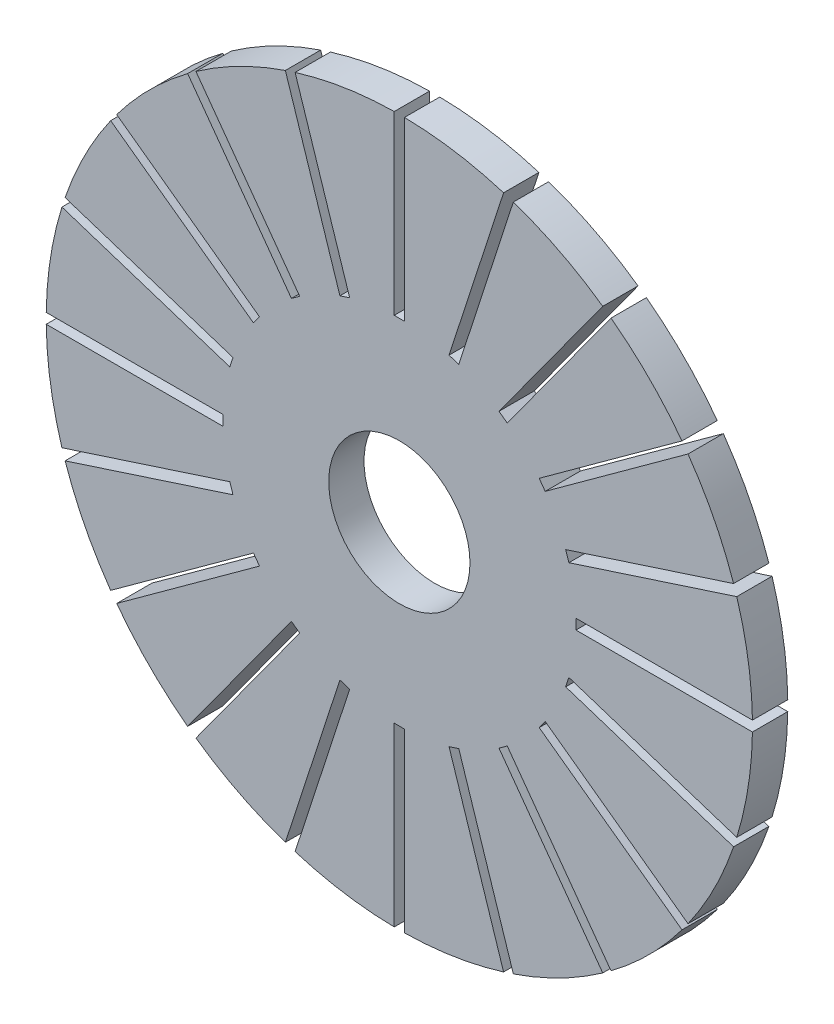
ISO-10303-21;
HEADER;
FILE_DESCRIPTION(('STEP AP214'),'2;1');
FILE_NAME('part.step','',(''),(''),'','','');
FILE_SCHEMA(('AUTOMOTIVE_DESIGN { 1 0 10303 214 1 1 1 1 }'));
ENDSEC;
DATA;
#1=APPLICATION_CONTEXT('core data for automotive mechanical design processes');
#2=APPLICATION_PROTOCOL_DEFINITION('international standard','automotive_design',2000,#1);
#3=PRODUCT_CONTEXT('',#1,'mechanical');
#4=PRODUCT('Part','Part','',(#3));
#5=PRODUCT_RELATED_PRODUCT_CATEGORY('part','',(#4));
#6=PRODUCT_DEFINITION_FORMATION('','',#4);
#7=PRODUCT_DEFINITION_CONTEXT('part definition',#1,'design');
#8=PRODUCT_DEFINITION('design','',#6,#7);
#9=PRODUCT_DEFINITION_SHAPE('','',#8);
#10=(LENGTH_UNIT() NAMED_UNIT(*) SI_UNIT(.MILLI.,.METRE.));
#11=(NAMED_UNIT(*) PLANE_ANGLE_UNIT() SI_UNIT($,.RADIAN.));
#12=(NAMED_UNIT(*) SI_UNIT($,.STERADIAN.) SOLID_ANGLE_UNIT());
#13=UNCERTAINTY_MEASURE_WITH_UNIT(LENGTH_MEASURE(1.E-05),#10,'distance_accuracy_value','');
#14=(GEOMETRIC_REPRESENTATION_CONTEXT(3) GLOBAL_UNCERTAINTY_ASSIGNED_CONTEXT((#13)) GLOBAL_UNIT_ASSIGNED_CONTEXT((#10,
#11,#12)) REPRESENTATION_CONTEXT('',''));
#15=CARTESIAN_POINT('',(0.,0.,0.));
#16=DIRECTION('',(0.,0.,1.));
#17=DIRECTION('',(1.,0.,0.));
#18=AXIS2_PLACEMENT_3D('',#15,#16,#17);
#19=CARTESIAN_POINT('',(-1.37903194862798,0.448074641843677,10.));
#20=DIRECTION('',(-0.951056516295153,0.309016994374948,0.));
#21=DIRECTION('',(-0.309016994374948,-0.951056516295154,0.));
#22=AXIS2_PLACEMENT_3D('',#19,#20,#21);
#23=PLANE('',#22);
#24=DIRECTION('',(0.309016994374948,0.951056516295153,0.));
#25=VECTOR('',#24,1.);
#26=CARTESIAN_POINT('',(-1.37903194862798,0.448074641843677,0.));
#27=LINE('',#26,#25);
#28=CARTESIAN_POINT('',(14.0718177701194,48.0009004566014,0.));
#29=VERTEX_POINT('',#28);
#30=CARTESIAN_POINT('',(29.5194187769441,95.5437277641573,0.));
#31=VERTEX_POINT('',#30);
#32=EDGE_CURVE('E570',#29,#31,#27,.T.);
#33=ORIENTED_EDGE('',*,*,#32,.T.);
#34=DIRECTION('',(0.,0.,-1.));
#35=VECTOR('',#34,1.);
#36=CARTESIAN_POINT('',(29.5194187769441,95.5437277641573,10.));
#37=LINE('',#36,#35);
#38=CARTESIAN_POINT('',(29.5194187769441,95.5437277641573,10.));
#39=VERTEX_POINT('',#38);
#40=EDGE_CURVE('E11',#39,#31,#37,.T.);
#41=ORIENTED_EDGE('',*,*,#40,.F.);
#42=DIRECTION('',(0.309016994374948,0.951056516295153,0.));
#43=VECTOR('',#42,1.);
#44=CARTESIAN_POINT('',(-1.37903194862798,0.448074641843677,10.));
#45=LINE('',#44,#43);
#46=CARTESIAN_POINT('',(14.0718177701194,48.0009004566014,10.));
#47=VERTEX_POINT('',#46);
#48=EDGE_CURVE('E1493',#47,#39,#45,.T.);
#49=ORIENTED_EDGE('',*,*,#48,.F.);
#50=DIRECTION('',(0.,0.,-1.));
#51=VECTOR('',#50,1.);
#52=CARTESIAN_POINT('',(14.0718177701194,48.0009004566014,10.));
#53=LINE('',#52,#51);
#54=EDGE_CURVE('E562',#47,#29,#53,.T.);
#55=ORIENTED_EDGE('',*,*,#54,.T.);
#56=EDGE_LOOP('',(#33,#41,#49,#55));
#57=FACE_BOUND('',#56,.T.);
#58=ADVANCED_FACE('F37',(#57),#23,.F.);
#59=CARTESIAN_POINT('',(0.,0.,10.));
#60=DIRECTION('',(0.,0.,-1.));
#61=DIRECTION('',(-1.,0.,0.));
#62=AXIS2_PLACEMENT_3D('',#59,#60,#61);
#63=CYLINDRICAL_SURFACE('',#62,100.);
#64=CARTESIAN_POINT('',(0.,0.,0.));
#65=DIRECTION('',(0.,0.,1.));
#66=DIRECTION('',(1.,0.,0.));
#67=AXIS2_PLACEMENT_3D('',#64,#65,#66);
#68=CIRCLE('',#67,100.);
#69=CARTESIAN_POINT('',(1.45,99.9894869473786,0.));
#70=VERTEX_POINT('',#69);
#71=EDGE_CURVE('E573',#31,#70,#68,.T.);
#72=ORIENTED_EDGE('',*,*,#71,.T.);
#73=DIRECTION('',(0.,0.,-1.));
#74=VECTOR('',#73,1.);
#75=CARTESIAN_POINT('',(1.45,99.9894869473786,10.));
#76=LINE('',#75,#74);
#77=CARTESIAN_POINT('',(1.45,99.9894869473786,10.));
#78=VERTEX_POINT('',#77);
#79=EDGE_CURVE('E46',#78,#70,#76,.T.);
#80=ORIENTED_EDGE('',*,*,#79,.F.);
#81=CARTESIAN_POINT('',(0.,0.,10.));
#82=DIRECTION('',(0.,0.,1.));
#83=DIRECTION('',(1.,0.,0.));
#84=AXIS2_PLACEMENT_3D('',#81,#82,#83);
#85=CIRCLE('',#84,100.);
#86=EDGE_CURVE('E309',#39,#78,#85,.T.);
#87=ORIENTED_EDGE('',*,*,#86,.F.);
#88=ORIENTED_EDGE('',*,*,#40,.T.);
#89=EDGE_LOOP('',(#72,#80,#87,#88));
#90=FACE_BOUND('',#89,.T.);
#91=ADVANCED_FACE('F924',(#90),#63,.T.);
#92=CARTESIAN_POINT('',(1.44999999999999,0.,10.));
#93=DIRECTION('',(-1.,0.,0.));
#94=DIRECTION('',(0.,-1.,0.));
#95=AXIS2_PLACEMENT_3D('',#92,#93,#94);
#96=PLANE('',#95);
#97=DIRECTION('',(0.,1.,0.));
#98=VECTOR('',#97,1.);
#99=CARTESIAN_POINT('',(1.44999999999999,0.,0.));
#100=LINE('',#99,#98);
#101=CARTESIAN_POINT('',(1.44999999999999,50.,0.));
#102=VERTEX_POINT('',#101);
#103=EDGE_CURVE('E576',#102,#70,#100,.T.);
#104=ORIENTED_EDGE('',*,*,#103,.F.);
#105=DIRECTION('',(0.,0.,-1.));
#106=VECTOR('',#105,1.);
#107=CARTESIAN_POINT('',(1.44999999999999,50.,10.));
#108=LINE('',#107,#106);
#109=CARTESIAN_POINT('',(1.44999999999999,50.,10.));
#110=VERTEX_POINT('',#109);
#111=EDGE_CURVE('E917',#110,#102,#108,.T.);
#112=ORIENTED_EDGE('',*,*,#111,.F.);
#113=DIRECTION('',(0.,1.,0.));
#114=VECTOR('',#113,1.);
#115=CARTESIAN_POINT('',(1.44999999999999,0.,10.));
#116=LINE('',#115,#114);
#117=EDGE_CURVE('E923',#110,#78,#116,.T.);
#118=ORIENTED_EDGE('',*,*,#117,.T.);
#119=ORIENTED_EDGE('',*,*,#79,.T.);
#120=EDGE_LOOP('',(#104,#112,#118,#119));
#121=FACE_BOUND('',#120,.T.);
#122=ADVANCED_FACE('F921',(#121),#96,.T.);
#123=CARTESIAN_POINT('',(0.,50.,10.));
#124=DIRECTION('',(0.,-1.,0.));
#125=DIRECTION('',(0.,0.,-1.));
#126=AXIS2_PLACEMENT_3D('',#123,#124,#125);
#127=PLANE('',#126);
#128=DIRECTION('',(-1.,0.,0.));
#129=VECTOR('',#128,1.);
#130=CARTESIAN_POINT('',(0.,50.,0.));
#131=LINE('',#130,#129);
#132=CARTESIAN_POINT('',(-1.45000000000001,50.,0.));
#133=VERTEX_POINT('',#132);
#134=EDGE_CURVE('E580',#102,#133,#131,.T.);
#135=ORIENTED_EDGE('',*,*,#134,.T.);
#136=DIRECTION('',(0.,0.,-1.));
#137=VECTOR('',#136,1.);
#138=CARTESIAN_POINT('',(-1.45000000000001,50.,10.));
#139=LINE('',#138,#137);
#140=CARTESIAN_POINT('',(-1.45000000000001,50.,10.));
#141=VERTEX_POINT('',#140);
#142=EDGE_CURVE('E914',#141,#133,#139,.T.);
#143=ORIENTED_EDGE('',*,*,#142,.F.);
#144=DIRECTION('',(-1.,0.,0.));
#145=VECTOR('',#144,1.);
#146=CARTESIAN_POINT('',(0.,50.,10.));
#147=LINE('',#146,#145);
#148=EDGE_CURVE('E943',#110,#141,#147,.T.);
#149=ORIENTED_EDGE('',*,*,#148,.F.);
#150=ORIENTED_EDGE('',*,*,#111,.T.);
#151=EDGE_LOOP('',(#135,#143,#149,#150));
#152=FACE_BOUND('',#151,.T.);
#153=ADVANCED_FACE('F934',(#152),#127,.F.);
#154=CARTESIAN_POINT('',(-1.45000000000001,0.,10.));
#155=DIRECTION('',(-1.,0.,0.));
#156=DIRECTION('',(0.,-1.,0.));
#157=AXIS2_PLACEMENT_3D('',#154,#155,#156);
#158=PLANE('',#157);
#159=DIRECTION('',(0.,1.,0.));
#160=VECTOR('',#159,1.);
#161=CARTESIAN_POINT('',(-1.45000000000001,0.,0.));
#162=LINE('',#161,#160);
#163=CARTESIAN_POINT('',(-1.45,99.9894869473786,0.));
#164=VERTEX_POINT('',#163);
#165=EDGE_CURVE('E582',#133,#164,#162,.T.);
#166=ORIENTED_EDGE('',*,*,#165,.T.);
#167=DIRECTION('',(0.,0.,-1.));
#168=VECTOR('',#167,1.);
#169=CARTESIAN_POINT('',(-1.45,99.9894869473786,10.));
#170=LINE('',#169,#168);
#171=CARTESIAN_POINT('',(-1.45,99.9894869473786,10.));
#172=VERTEX_POINT('',#171);
#173=EDGE_CURVE('E911',#172,#164,#170,.T.);
#174=ORIENTED_EDGE('',*,*,#173,.F.);
#175=DIRECTION('',(0.,1.,0.));
#176=VECTOR('',#175,1.);
#177=CARTESIAN_POINT('',(-1.45000000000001,0.,10.));
#178=LINE('',#177,#176);
#179=EDGE_CURVE('E940',#141,#172,#178,.T.);
#180=ORIENTED_EDGE('',*,*,#179,.F.);
#181=ORIENTED_EDGE('',*,*,#142,.T.);
#182=EDGE_LOOP('',(#166,#174,#180,#181));
#183=FACE_BOUND('',#182,.T.);
#184=ADVANCED_FACE('F938',(#183),#158,.F.);
#185=CARTESIAN_POINT('',(-29.5194187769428,95.5437277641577,0.));
#186=VERTEX_POINT('',#185);
#187=EDGE_CURVE('E577',#164,#186,#68,.T.);
#188=ORIENTED_EDGE('',*,*,#187,.T.);
#189=DIRECTION('',(0.,0.,-1.));
#190=VECTOR('',#189,1.);
#191=CARTESIAN_POINT('',(-29.5194187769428,95.5437277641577,10.));
#192=LINE('',#191,#190);
#193=CARTESIAN_POINT('',(-29.5194187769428,95.5437277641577,10.));
#194=VERTEX_POINT('',#193);
#195=EDGE_CURVE('E909',#194,#186,#192,.T.);
#196=ORIENTED_EDGE('',*,*,#195,.F.);
#197=EDGE_CURVE('E942',#172,#194,#85,.T.);
#198=ORIENTED_EDGE('',*,*,#197,.F.);
#199=ORIENTED_EDGE('',*,*,#173,.T.);
#200=EDGE_LOOP('',(#188,#196,#198,#199));
#201=FACE_BOUND('',#200,.T.);
#202=ADVANCED_FACE('F1166',(#201),#63,.T.);
#203=CARTESIAN_POINT('',(1.37903194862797,0.448074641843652,10.));
#204=DIRECTION('',(-0.951056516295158,-0.309016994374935,0.));
#205=DIRECTION('',(0.309016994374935,-0.951056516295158,0.));
#206=AXIS2_PLACEMENT_3D('',#203,#204,#205);
#207=PLANE('',#206);
#208=DIRECTION('',(-0.309016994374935,0.951056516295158,0.));
#209=VECTOR('',#208,1.);
#210=CARTESIAN_POINT('',(1.37903194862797,0.448074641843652,0.));
#211=LINE('',#210,#209);
#212=CARTESIAN_POINT('',(-14.0718177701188,48.0009004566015,0.));
#213=VERTEX_POINT('',#212);
#214=EDGE_CURVE('E584',#213,#186,#211,.T.);
#215=ORIENTED_EDGE('',*,*,#214,.F.);
#216=DIRECTION('',(0.,0.,-1.));
#217=VECTOR('',#216,1.);
#218=CARTESIAN_POINT('',(-14.0718177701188,48.0009004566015,10.));
#219=LINE('',#218,#217);
#220=CARTESIAN_POINT('',(-14.0718177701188,48.0009004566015,10.));
#221=VERTEX_POINT('',#220);
#222=EDGE_CURVE('E907',#221,#213,#219,.T.);
#223=ORIENTED_EDGE('',*,*,#222,.F.);
#224=DIRECTION('',(-0.309016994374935,0.951056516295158,0.));
#225=VECTOR('',#224,1.);
#226=CARTESIAN_POINT('',(1.37903194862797,0.448074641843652,10.));
#227=LINE('',#226,#225);
#228=EDGE_CURVE('E945',#221,#194,#227,.T.);
#229=ORIENTED_EDGE('',*,*,#228,.T.);
#230=ORIENTED_EDGE('',*,*,#195,.T.);
#231=EDGE_LOOP('',(#215,#223,#229,#230));
#232=FACE_BOUND('',#231,.T.);
#233=ADVANCED_FACE('F1171',(#232),#207,.T.);
#234=CARTESIAN_POINT('',(-15.4508497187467,47.5528258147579,10.));
#235=DIRECTION('',(0.309016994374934,-0.951056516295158,0.));
#236=DIRECTION('',(0.951056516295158,0.309016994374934,0.));
#237=AXIS2_PLACEMENT_3D('',#234,#235,#236);
#238=PLANE('',#237);
#239=DIRECTION('',(-0.951056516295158,-0.309016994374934,0.));
#240=VECTOR('',#239,1.);
#241=CARTESIAN_POINT('',(-15.4508497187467,47.5528258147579,0.));
#242=LINE('',#241,#240);
#243=CARTESIAN_POINT('',(-16.8298816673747,47.1047511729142,0.));
#244=VERTEX_POINT('',#243);
#245=EDGE_CURVE('E587',#213,#244,#242,.T.);
#246=ORIENTED_EDGE('',*,*,#245,.T.);
#247=DIRECTION('',(0.,0.,-1.));
#248=VECTOR('',#247,1.);
#249=CARTESIAN_POINT('',(-16.8298816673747,47.1047511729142,10.));
#250=LINE('',#249,#248);
#251=CARTESIAN_POINT('',(-16.8298816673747,47.1047511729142,10.));
#252=VERTEX_POINT('',#251);
#253=EDGE_CURVE('E904',#252,#244,#250,.T.);
#254=ORIENTED_EDGE('',*,*,#253,.F.);
#255=DIRECTION('',(-0.951056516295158,-0.309016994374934,0.));
#256=VECTOR('',#255,1.);
#257=CARTESIAN_POINT('',(-15.4508497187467,47.5528258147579,10.));
#258=LINE('',#257,#256);
#259=EDGE_CURVE('E952',#221,#252,#258,.T.);
#260=ORIENTED_EDGE('',*,*,#259,.F.);
#261=ORIENTED_EDGE('',*,*,#222,.T.);
#262=EDGE_LOOP('',(#246,#254,#260,#261));
#263=FACE_BOUND('',#262,.T.);
#264=ADVANCED_FACE('F1178',(#263),#238,.F.);
#265=CARTESIAN_POINT('',(-1.37903194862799,-0.448074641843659,10.));
#266=DIRECTION('',(-0.951056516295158,-0.309016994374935,0.));
#267=DIRECTION('',(0.309016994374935,-0.951056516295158,0.));
#268=AXIS2_PLACEMENT_3D('',#265,#266,#267);
#269=PLANE('',#268);
#270=DIRECTION('',(-0.309016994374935,0.951056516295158,0.));
#271=VECTOR('',#270,1.);
#272=CARTESIAN_POINT('',(-1.37903194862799,-0.448074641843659,0.));
#273=LINE('',#272,#271);
#274=CARTESIAN_POINT('',(-32.2774826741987,94.6475784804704,0.));
#275=VERTEX_POINT('',#274);
#276=EDGE_CURVE('E589',#244,#275,#273,.T.);
#277=ORIENTED_EDGE('',*,*,#276,.T.);
#278=DIRECTION('',(0.,0.,-1.));
#279=VECTOR('',#278,1.);
#280=CARTESIAN_POINT('',(-32.2774826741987,94.6475784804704,10.));
#281=LINE('',#280,#279);
#282=CARTESIAN_POINT('',(-32.2774826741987,94.6475784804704,10.));
#283=VERTEX_POINT('',#282);
#284=EDGE_CURVE('E901',#283,#275,#281,.T.);
#285=ORIENTED_EDGE('',*,*,#284,.F.);
#286=DIRECTION('',(-0.309016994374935,0.951056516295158,0.));
#287=VECTOR('',#286,1.);
#288=CARTESIAN_POINT('',(-1.37903194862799,-0.448074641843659,10.));
#289=LINE('',#288,#287);
#290=EDGE_CURVE('E954',#252,#283,#289,.T.);
#291=ORIENTED_EDGE('',*,*,#290,.F.);
#292=ORIENTED_EDGE('',*,*,#253,.T.);
#293=EDGE_LOOP('',(#277,#285,#291,#292));
#294=FACE_BOUND('',#293,.T.);
#295=ADVANCED_FACE('F1180',(#294),#269,.F.);
#296=CARTESIAN_POINT('',(-57.5992711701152,81.7454828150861,0.));
#297=VERTEX_POINT('',#296);
#298=EDGE_CURVE('E591',#275,#297,#68,.T.);
#299=ORIENTED_EDGE('',*,*,#298,.T.);
#300=DIRECTION('',(0.,0.,-1.));
#301=VECTOR('',#300,1.);
#302=CARTESIAN_POINT('',(-57.5992711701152,81.7454828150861,10.));
#303=LINE('',#302,#301);
#304=CARTESIAN_POINT('',(-57.5992711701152,81.7454828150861,10.));
#305=VERTEX_POINT('',#304);
#306=EDGE_CURVE('E899',#305,#297,#303,.T.);
#307=ORIENTED_EDGE('',*,*,#306,.F.);
#308=EDGE_CURVE('E946',#283,#305,#85,.T.);
#309=ORIENTED_EDGE('',*,*,#308,.F.);
#310=ORIENTED_EDGE('',*,*,#284,.T.);
#311=EDGE_LOOP('',(#299,#307,#309,#310));
#312=FACE_BOUND('',#311,.T.);
#313=ADVANCED_FACE('F1182',(#312),#63,.T.);
#314=CARTESIAN_POINT('',(1.17307464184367,0.85228861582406,10.));
#315=DIRECTION('',(-0.809016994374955,-0.587785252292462,0.));
#316=DIRECTION('',(0.587785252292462,-0.809016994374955,0.));
#317=AXIS2_PLACEMENT_3D('',#314,#315,#316);
#318=PLANE('',#317);
#319=DIRECTION('',(-0.587785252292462,0.809016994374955,0.));
#320=VECTOR('',#319,1.);
#321=CARTESIAN_POINT('',(1.17307464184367,0.85228861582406,0.));
#322=LINE('',#321,#320);
#323=CARTESIAN_POINT('',(-28.2161879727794,41.3031383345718,0.));
#324=VERTEX_POINT('',#323);
#325=EDGE_CURVE('E592',#324,#297,#322,.T.);
#326=ORIENTED_EDGE('',*,*,#325,.F.);
#327=DIRECTION('',(0.,0.,-1.));
#328=VECTOR('',#327,1.);
#329=CARTESIAN_POINT('',(-28.2161879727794,41.3031383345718,10.));
#330=LINE('',#329,#328);
#331=CARTESIAN_POINT('',(-28.2161879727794,41.3031383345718,10.));
#332=VERTEX_POINT('',#331);
#333=EDGE_CURVE('E897',#332,#324,#330,.T.);
#334=ORIENTED_EDGE('',*,*,#333,.F.);
#335=DIRECTION('',(-0.587785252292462,0.809016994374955,0.));
#336=VECTOR('',#335,1.);
#337=CARTESIAN_POINT('',(1.17307464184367,0.85228861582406,10.));
#338=LINE('',#337,#336);
#339=EDGE_CURVE('E956',#332,#305,#338,.T.);
#340=ORIENTED_EDGE('',*,*,#339,.T.);
#341=ORIENTED_EDGE('',*,*,#306,.T.);
#342=EDGE_LOOP('',(#326,#334,#340,#341));
#343=FACE_BOUND('',#342,.T.);
#344=ADVANCED_FACE('F1277',(#343),#318,.T.);
#345=CARTESIAN_POINT('',(-29.389262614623,40.4508497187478,10.));
#346=DIRECTION('',(0.58778525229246,-0.809016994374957,0.));
#347=DIRECTION('',(0.809016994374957,0.58778525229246,0.));
#348=AXIS2_PLACEMENT_3D('',#345,#346,#347);
#349=PLANE('',#348);
#350=DIRECTION('',(-0.809016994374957,-0.58778525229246,0.));
#351=VECTOR('',#350,1.);
#352=CARTESIAN_POINT('',(-29.389262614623,40.4508497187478,0.));
#353=LINE('',#352,#351);
#354=CARTESIAN_POINT('',(-30.5623372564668,39.5985611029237,0.));
#355=VERTEX_POINT('',#354);
#356=EDGE_CURVE('E595',#324,#355,#353,.T.);
#357=ORIENTED_EDGE('',*,*,#356,.T.);
#358=DIRECTION('',(0.,0.,-1.));
#359=VECTOR('',#358,1.);
#360=CARTESIAN_POINT('',(-30.5623372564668,39.5985611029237,10.));
#361=LINE('',#360,#359);
#362=CARTESIAN_POINT('',(-30.5623372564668,39.5985611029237,10.));
#363=VERTEX_POINT('',#362);
#364=EDGE_CURVE('E894',#363,#355,#361,.T.);
#365=ORIENTED_EDGE('',*,*,#364,.F.);
#366=DIRECTION('',(-0.809016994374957,-0.58778525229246,0.));
#367=VECTOR('',#366,1.);
#368=CARTESIAN_POINT('',(-29.389262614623,40.4508497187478,10.));
#369=LINE('',#368,#367);
#370=EDGE_CURVE('E959',#332,#363,#369,.T.);
#371=ORIENTED_EDGE('',*,*,#370,.F.);
#372=ORIENTED_EDGE('',*,*,#333,.T.);
#373=EDGE_LOOP('',(#357,#365,#371,#372));
#374=FACE_BOUND('',#373,.T.);
#375=ADVANCED_FACE('F1280',(#374),#349,.F.);
#376=CARTESIAN_POINT('',(-1.17307464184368,-0.852288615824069,10.));
#377=DIRECTION('',(-0.809016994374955,-0.587785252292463,0.));
#378=DIRECTION('',(0.587785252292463,-0.809016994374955,0.));
#379=AXIS2_PLACEMENT_3D('',#376,#377,#378);
#380=PLANE('',#379);
#381=DIRECTION('',(-0.587785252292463,0.809016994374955,0.));
#382=VECTOR('',#381,1.);
#383=CARTESIAN_POINT('',(-1.17307464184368,-0.852288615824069,0.));
#384=LINE('',#383,#382);
#385=CARTESIAN_POINT('',(-59.9454204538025,80.040905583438,0.));
#386=VERTEX_POINT('',#385);
#387=EDGE_CURVE('E597',#355,#386,#384,.T.);
#388=ORIENTED_EDGE('',*,*,#387,.T.);
#389=DIRECTION('',(0.,0.,-1.));
#390=VECTOR('',#389,1.);
#391=CARTESIAN_POINT('',(-59.9454204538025,80.040905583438,10.));
#392=LINE('',#391,#390);
#393=CARTESIAN_POINT('',(-59.9454204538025,80.040905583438,10.));
#394=VERTEX_POINT('',#393);
#395=EDGE_CURVE('E891',#394,#386,#392,.T.);
#396=ORIENTED_EDGE('',*,*,#395,.F.);
#397=DIRECTION('',(-0.587785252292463,0.809016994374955,0.));
#398=VECTOR('',#397,1.);
#399=CARTESIAN_POINT('',(-1.17307464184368,-0.852288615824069,10.));
#400=LINE('',#399,#398);
#401=EDGE_CURVE('E961',#363,#394,#400,.T.);
#402=ORIENTED_EDGE('',*,*,#401,.F.);
#403=ORIENTED_EDGE('',*,*,#364,.T.);
#404=EDGE_LOOP('',(#388,#396,#402,#403));
#405=FACE_BOUND('',#404,.T.);
#406=ADVANCED_FACE('F1284',(#405),#380,.F.);
#407=CARTESIAN_POINT('',(-80.0409055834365,59.9454204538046,0.));
#408=VERTEX_POINT('',#407);
#409=EDGE_CURVE('E599',#386,#408,#68,.T.);
#410=ORIENTED_EDGE('',*,*,#409,.T.);
#411=DIRECTION('',(0.,0.,-1.));
#412=VECTOR('',#411,1.);
#413=CARTESIAN_POINT('',(-80.0409055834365,59.9454204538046,10.));
#414=LINE('',#413,#412);
#415=CARTESIAN_POINT('',(-80.0409055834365,59.9454204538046,10.));
#416=VERTEX_POINT('',#415);
#417=EDGE_CURVE('E889',#416,#408,#414,.T.);
#418=ORIENTED_EDGE('',*,*,#417,.F.);
#419=EDGE_CURVE('E963',#394,#416,#85,.T.);
#420=ORIENTED_EDGE('',*,*,#419,.F.);
#421=ORIENTED_EDGE('',*,*,#395,.T.);
#422=EDGE_LOOP('',(#410,#418,#420,#421));
#423=FACE_BOUND('',#422,.T.);
#424=ADVANCED_FACE('F1288',(#423),#63,.T.);
#425=CARTESIAN_POINT('',(0.852288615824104,1.17307464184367,10.));
#426=DIRECTION('',(-0.587785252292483,-0.80901699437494,0.));
#427=DIRECTION('',(0.80901699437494,-0.587785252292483,0.));
#428=AXIS2_PLACEMENT_3D('',#425,#426,#427);
#429=PLANE('',#428);
#430=DIRECTION('',(-0.80901699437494,0.587785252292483,0.));
#431=VECTOR('',#430,1.);
#432=CARTESIAN_POINT('',(0.852288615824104,1.17307464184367,0.));
#433=LINE('',#432,#431);
#434=CARTESIAN_POINT('',(-39.5985611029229,30.5623372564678,0.));
#435=VERTEX_POINT('',#434);
#436=EDGE_CURVE('E600',#435,#408,#433,.T.);
#437=ORIENTED_EDGE('',*,*,#436,.F.);
#438=DIRECTION('',(0.,0.,-1.));
#439=VECTOR('',#438,1.);
#440=CARTESIAN_POINT('',(-39.5985611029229,30.5623372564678,10.));
#441=LINE('',#440,#439);
#442=CARTESIAN_POINT('',(-39.5985611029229,30.5623372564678,10.));
#443=VERTEX_POINT('',#442);
#444=EDGE_CURVE('E887',#443,#435,#441,.T.);
#445=ORIENTED_EDGE('',*,*,#444,.F.);
#446=DIRECTION('',(-0.80901699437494,0.587785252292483,0.));
#447=VECTOR('',#446,1.);
#448=CARTESIAN_POINT('',(0.852288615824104,1.17307464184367,10.));
#449=LINE('',#448,#447);
#450=EDGE_CURVE('E964',#443,#416,#449,.T.);
#451=ORIENTED_EDGE('',*,*,#450,.T.);
#452=ORIENTED_EDGE('',*,*,#417,.T.);
#453=EDGE_LOOP('',(#437,#445,#451,#452));
#454=FACE_BOUND('',#453,.T.);
#455=ADVANCED_FACE('F1290',(#454),#429,.T.);
#456=CARTESIAN_POINT('',(-40.4508497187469,29.3892626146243,10.));
#457=DIRECTION('',(0.809016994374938,-0.587785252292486,0.));
#458=DIRECTION('',(0.587785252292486,0.809016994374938,0.));
#459=AXIS2_PLACEMENT_3D('',#456,#457,#458);
#460=PLANE('',#459);
#461=DIRECTION('',(-0.587785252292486,-0.809016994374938,0.));
#462=VECTOR('',#461,1.);
#463=CARTESIAN_POINT('',(-40.4508497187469,29.3892626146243,0.));
#464=LINE('',#463,#462);
#465=CARTESIAN_POINT('',(-41.3031383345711,28.2161879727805,0.));
#466=VERTEX_POINT('',#465);
#467=EDGE_CURVE('E603',#435,#466,#464,.T.);
#468=ORIENTED_EDGE('',*,*,#467,.T.);
#469=DIRECTION('',(0.,0.,-1.));
#470=VECTOR('',#469,1.);
#471=CARTESIAN_POINT('',(-41.3031383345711,28.2161879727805,10.));
#472=LINE('',#471,#470);
#473=CARTESIAN_POINT('',(-41.3031383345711,28.2161879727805,10.));
#474=VERTEX_POINT('',#473);
#475=EDGE_CURVE('E884',#474,#466,#472,.T.);
#476=ORIENTED_EDGE('',*,*,#475,.F.);
#477=DIRECTION('',(-0.587785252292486,-0.809016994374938,0.));
#478=VECTOR('',#477,1.);
#479=CARTESIAN_POINT('',(-40.4508497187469,29.3892626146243,10.));
#480=LINE('',#479,#478);
#481=EDGE_CURVE('E967',#443,#474,#480,.T.);
#482=ORIENTED_EDGE('',*,*,#481,.F.);
#483=ORIENTED_EDGE('',*,*,#444,.T.);
#484=EDGE_LOOP('',(#468,#476,#482,#483));
#485=FACE_BOUND('',#484,.T.);
#486=ADVANCED_FACE('F1293',(#485),#460,.F.);
#487=CARTESIAN_POINT('',(-0.852288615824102,-1.17307464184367,10.));
#488=DIRECTION('',(-0.587785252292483,-0.80901699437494,0.));
#489=DIRECTION('',(0.80901699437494,-0.587785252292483,0.));
#490=AXIS2_PLACEMENT_3D('',#487,#488,#489);
#491=PLANE('',#490);
#492=DIRECTION('',(-0.80901699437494,0.587785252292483,0.));
#493=VECTOR('',#492,1.);
#494=CARTESIAN_POINT('',(-0.852288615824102,-1.17307464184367,0.));
#495=LINE('',#494,#493);
#496=CARTESIAN_POINT('',(-81.7454828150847,57.5992711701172,0.));
#497=VERTEX_POINT('',#496);
#498=EDGE_CURVE('E605',#466,#497,#495,.T.);
#499=ORIENTED_EDGE('',*,*,#498,.T.);
#500=DIRECTION('',(0.,0.,-1.));
#501=VECTOR('',#500,1.);
#502=CARTESIAN_POINT('',(-81.7454828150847,57.5992711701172,10.));
#503=LINE('',#502,#501);
#504=CARTESIAN_POINT('',(-81.7454828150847,57.5992711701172,10.));
#505=VERTEX_POINT('',#504);
#506=EDGE_CURVE('E881',#505,#497,#503,.T.);
#507=ORIENTED_EDGE('',*,*,#506,.F.);
#508=DIRECTION('',(-0.80901699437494,0.587785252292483,0.));
#509=VECTOR('',#508,1.);
#510=CARTESIAN_POINT('',(-0.852288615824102,-1.17307464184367,10.));
#511=LINE('',#510,#509);
#512=EDGE_CURVE('E969',#474,#505,#511,.T.);
#513=ORIENTED_EDGE('',*,*,#512,.F.);
#514=ORIENTED_EDGE('',*,*,#475,.T.);
#515=EDGE_LOOP('',(#499,#507,#513,#514));
#516=FACE_BOUND('',#515,.T.);
#517=ADVANCED_FACE('F1297',(#516),#491,.F.);
#518=CARTESIAN_POINT('',(-94.6475784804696,32.277482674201,0.));
#519=VERTEX_POINT('',#518);
#520=EDGE_CURVE('E607',#497,#519,#68,.T.);
#521=ORIENTED_EDGE('',*,*,#520,.T.);
#522=DIRECTION('',(0.,0.,-1.));
#523=VECTOR('',#522,1.);
#524=CARTESIAN_POINT('',(-94.6475784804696,32.277482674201,10.));
#525=LINE('',#524,#523);
#526=CARTESIAN_POINT('',(-94.6475784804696,32.277482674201,10.));
#527=VERTEX_POINT('',#526);
#528=EDGE_CURVE('E879',#527,#519,#525,.T.);
#529=ORIENTED_EDGE('',*,*,#528,.F.);
#530=EDGE_CURVE('E971',#505,#527,#85,.T.);
#531=ORIENTED_EDGE('',*,*,#530,.F.);
#532=ORIENTED_EDGE('',*,*,#506,.T.);
#533=EDGE_LOOP('',(#521,#529,#531,#532));
#534=FACE_BOUND('',#533,.T.);
#535=ADVANCED_FACE('F1301',(#534),#63,.T.);
#536=CARTESIAN_POINT('',(0.448074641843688,1.37903194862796,10.));
#537=DIRECTION('',(-0.309016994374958,-0.95105651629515,0.));
#538=DIRECTION('',(0.95105651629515,-0.309016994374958,0.));
#539=AXIS2_PLACEMENT_3D('',#536,#537,#538);
#540=PLANE('',#539);
#541=DIRECTION('',(-0.95105651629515,0.309016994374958,0.));
#542=VECTOR('',#541,1.);
#543=CARTESIAN_POINT('',(0.448074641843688,1.37903194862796,0.));
#544=LINE('',#543,#542);
#545=CARTESIAN_POINT('',(-47.1047511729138,16.8298816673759,0.));
#546=VERTEX_POINT('',#545);
#547=EDGE_CURVE('E608',#546,#519,#544,.T.);
#548=ORIENTED_EDGE('',*,*,#547,.F.);
#549=DIRECTION('',(0.,0.,-1.));
#550=VECTOR('',#549,1.);
#551=CARTESIAN_POINT('',(-47.1047511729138,16.8298816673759,10.));
#552=LINE('',#551,#550);
#553=CARTESIAN_POINT('',(-47.1047511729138,16.8298816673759,10.));
#554=VERTEX_POINT('',#553);
#555=EDGE_CURVE('E877',#554,#546,#552,.T.);
#556=ORIENTED_EDGE('',*,*,#555,.F.);
#557=DIRECTION('',(-0.95105651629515,0.309016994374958,0.));
#558=VECTOR('',#557,1.);
#559=CARTESIAN_POINT('',(0.448074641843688,1.37903194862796,10.));
#560=LINE('',#559,#558);
#561=EDGE_CURVE('E972',#554,#527,#560,.T.);
#562=ORIENTED_EDGE('',*,*,#561,.T.);
#563=ORIENTED_EDGE('',*,*,#528,.T.);
#564=EDGE_LOOP('',(#548,#556,#562,#563));
#565=FACE_BOUND('',#564,.T.);
#566=ADVANCED_FACE('F1303',(#565),#540,.T.);
#567=CARTESIAN_POINT('',(-47.5528258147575,15.4508497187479,10.));
#568=DIRECTION('',(0.95105651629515,-0.309016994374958,0.));
#569=DIRECTION('',(0.309016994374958,0.95105651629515,0.));
#570=AXIS2_PLACEMENT_3D('',#567,#568,#569);
#571=PLANE('',#570);
#572=DIRECTION('',(-0.309016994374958,-0.95105651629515,0.));
#573=VECTOR('',#572,1.);
#574=CARTESIAN_POINT('',(-47.5528258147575,15.4508497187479,0.));
#575=LINE('',#574,#573);
#576=CARTESIAN_POINT('',(-48.0009004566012,14.0718177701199,0.));
#577=VERTEX_POINT('',#576);
#578=EDGE_CURVE('E611',#546,#577,#575,.T.);
#579=ORIENTED_EDGE('',*,*,#578,.T.);
#580=DIRECTION('',(0.,0.,-1.));
#581=VECTOR('',#580,1.);
#582=CARTESIAN_POINT('',(-48.0009004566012,14.0718177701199,10.));
#583=LINE('',#582,#581);
#584=CARTESIAN_POINT('',(-48.0009004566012,14.0718177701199,10.));
#585=VERTEX_POINT('',#584);
#586=EDGE_CURVE('E874',#585,#577,#583,.T.);
#587=ORIENTED_EDGE('',*,*,#586,.F.);
#588=DIRECTION('',(-0.309016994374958,-0.95105651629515,0.));
#589=VECTOR('',#588,1.);
#590=CARTESIAN_POINT('',(-47.5528258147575,15.4508497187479,10.));
#591=LINE('',#590,#589);
#592=EDGE_CURVE('E975',#554,#585,#591,.T.);
#593=ORIENTED_EDGE('',*,*,#592,.F.);
#594=ORIENTED_EDGE('',*,*,#555,.T.);
#595=EDGE_LOOP('',(#579,#587,#593,#594));
#596=FACE_BOUND('',#595,.T.);
#597=ADVANCED_FACE('F1306',(#596),#571,.F.);
#598=CARTESIAN_POINT('',(-0.448074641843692,-1.37903194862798,10.));
#599=DIRECTION('',(-0.309016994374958,-0.95105651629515,0.));
#600=DIRECTION('',(0.95105651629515,-0.309016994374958,0.));
#601=AXIS2_PLACEMENT_3D('',#598,#599,#600);
#602=PLANE('',#601);
#603=DIRECTION('',(-0.95105651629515,0.309016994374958,0.));
#604=VECTOR('',#603,1.);
#605=CARTESIAN_POINT('',(-0.448074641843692,-1.37903194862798,0.));
#606=LINE('',#605,#604);
#607=CARTESIAN_POINT('',(-95.543727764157,29.5194187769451,0.));
#608=VERTEX_POINT('',#607);
#609=EDGE_CURVE('E613',#577,#608,#606,.T.);
#610=ORIENTED_EDGE('',*,*,#609,.T.);
#611=DIRECTION('',(0.,0.,-1.));
#612=VECTOR('',#611,1.);
#613=CARTESIAN_POINT('',(-95.543727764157,29.5194187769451,10.));
#614=LINE('',#613,#612);
#615=CARTESIAN_POINT('',(-95.543727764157,29.5194187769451,10.));
#616=VERTEX_POINT('',#615);
#617=EDGE_CURVE('E871',#616,#608,#614,.T.);
#618=ORIENTED_EDGE('',*,*,#617,.F.);
#619=DIRECTION('',(-0.95105651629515,0.309016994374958,0.));
#620=VECTOR('',#619,1.);
#621=CARTESIAN_POINT('',(-0.448074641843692,-1.37903194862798,10.));
#622=LINE('',#621,#620);
#623=EDGE_CURVE('E977',#585,#616,#622,.T.);
#624=ORIENTED_EDGE('',*,*,#623,.F.);
#625=ORIENTED_EDGE('',*,*,#586,.T.);
#626=EDGE_LOOP('',(#610,#618,#624,#625));
#627=FACE_BOUND('',#626,.T.);
#628=ADVANCED_FACE('F1310',(#627),#602,.F.);
#629=CARTESIAN_POINT('',(-99.9894869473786,1.4500000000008,0.));
#630=VERTEX_POINT('',#629);
#631=EDGE_CURVE('E615',#608,#630,#68,.T.);
#632=ORIENTED_EDGE('',*,*,#631,.T.);
#633=DIRECTION('',(0.,0.,-1.));
#634=VECTOR('',#633,1.);
#635=CARTESIAN_POINT('',(-99.9894869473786,1.4500000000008,10.));
#636=LINE('',#635,#634);
#637=CARTESIAN_POINT('',(-99.9894869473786,1.4500000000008,10.));
#638=VERTEX_POINT('',#637);
#639=EDGE_CURVE('E869',#638,#630,#636,.T.);
#640=ORIENTED_EDGE('',*,*,#639,.F.);
#641=EDGE_CURVE('E979',#616,#638,#85,.T.);
#642=ORIENTED_EDGE('',*,*,#641,.F.);
#643=ORIENTED_EDGE('',*,*,#617,.T.);
#644=EDGE_LOOP('',(#632,#640,#642,#643));
#645=FACE_BOUND('',#644,.T.);
#646=ADVANCED_FACE('F1314',(#645),#63,.T.);
#647=CARTESIAN_POINT('',(0.,1.45000000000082,10.));
#648=DIRECTION('',(0.,-1.,0.));
#649=DIRECTION('',(1.,0.,0.));
#650=AXIS2_PLACEMENT_3D('',#647,#648,#649);
#651=PLANE('',#650);
#652=DIRECTION('',(-1.,0.,0.));
#653=VECTOR('',#652,1.);
#654=CARTESIAN_POINT('',(0.,1.45000000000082,0.));
#655=LINE('',#654,#653);
#656=CARTESIAN_POINT('',(-49.9999999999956,1.45000000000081,0.));
#657=VERTEX_POINT('',#656);
#658=EDGE_CURVE('E616',#657,#630,#655,.T.);
#659=ORIENTED_EDGE('',*,*,#658,.F.);
#660=DIRECTION('',(0.,0.,-1.));
#661=VECTOR('',#660,1.);
#662=CARTESIAN_POINT('',(-49.9999999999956,1.45000000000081,10.));
#663=LINE('',#662,#661);
#664=CARTESIAN_POINT('',(-49.9999999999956,1.45000000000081,10.));
#665=VERTEX_POINT('',#664);
#666=EDGE_CURVE('E867',#665,#657,#663,.T.);
#667=ORIENTED_EDGE('',*,*,#666,.F.);
#668=DIRECTION('',(-1.,0.,0.));
#669=VECTOR('',#668,1.);
#670=CARTESIAN_POINT('',(0.,1.45000000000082,10.));
#671=LINE('',#670,#669);
#672=EDGE_CURVE('E980',#665,#638,#671,.T.);
#673=ORIENTED_EDGE('',*,*,#672,.T.);
#674=ORIENTED_EDGE('',*,*,#639,.T.);
#675=EDGE_LOOP('',(#659,#667,#673,#674));
#676=FACE_BOUND('',#675,.T.);
#677=ADVANCED_FACE('F1316',(#676),#651,.T.);
#678=CARTESIAN_POINT('',(-49.9999999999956,0.,10.));
#679=DIRECTION('',(1.,0.,0.));
#680=DIRECTION('',(0.,0.,-1.));
#681=AXIS2_PLACEMENT_3D('',#678,#679,#680);
#682=PLANE('',#681);
#683=DIRECTION('',(0.,-1.,0.));
#684=VECTOR('',#683,1.);
#685=CARTESIAN_POINT('',(-49.9999999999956,0.,0.));
#686=LINE('',#685,#684);
#687=CARTESIAN_POINT('',(-49.9999999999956,-1.44999999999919,0.));
#688=VERTEX_POINT('',#687);
#689=EDGE_CURVE('E619',#657,#688,#686,.T.);
#690=ORIENTED_EDGE('',*,*,#689,.T.);
#691=DIRECTION('',(0.,0.,-1.));
#692=VECTOR('',#691,1.);
#693=CARTESIAN_POINT('',(-49.9999999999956,-1.44999999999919,10.));
#694=LINE('',#693,#692);
#695=CARTESIAN_POINT('',(-49.9999999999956,-1.44999999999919,10.));
#696=VERTEX_POINT('',#695);
#697=EDGE_CURVE('E864',#696,#688,#694,.T.);
#698=ORIENTED_EDGE('',*,*,#697,.F.);
#699=DIRECTION('',(0.,-1.,0.));
#700=VECTOR('',#699,1.);
#701=CARTESIAN_POINT('',(-49.9999999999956,0.,10.));
#702=LINE('',#701,#700);
#703=EDGE_CURVE('E983',#665,#696,#702,.T.);
#704=ORIENTED_EDGE('',*,*,#703,.F.);
#705=ORIENTED_EDGE('',*,*,#666,.T.);
#706=EDGE_LOOP('',(#690,#698,#704,#705));
#707=FACE_BOUND('',#706,.T.);
#708=ADVANCED_FACE('F1319',(#707),#682,.F.);
#709=CARTESIAN_POINT('',(0.,-1.44999999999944,10.));
#710=DIRECTION('',(0.,-1.,0.));
#711=DIRECTION('',(1.,0.,0.));
#712=AXIS2_PLACEMENT_3D('',#709,#710,#711);
#713=PLANE('',#712);
#714=DIRECTION('',(-1.,0.,0.));
#715=VECTOR('',#714,1.);
#716=CARTESIAN_POINT('',(0.,-1.44999999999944,0.));
#717=LINE('',#716,#715);
#718=CARTESIAN_POINT('',(-99.9894869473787,-1.44999999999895,0.));
#719=VERTEX_POINT('',#718);
#720=EDGE_CURVE('E621',#688,#719,#717,.T.);
#721=ORIENTED_EDGE('',*,*,#720,.T.);
#722=DIRECTION('',(0.,0.,-1.));
#723=VECTOR('',#722,1.);
#724=CARTESIAN_POINT('',(-99.9894869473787,-1.44999999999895,10.));
#725=LINE('',#724,#723);
#726=CARTESIAN_POINT('',(-99.9894869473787,-1.44999999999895,10.));
#727=VERTEX_POINT('',#726);
#728=EDGE_CURVE('E861',#727,#719,#725,.T.);
#729=ORIENTED_EDGE('',*,*,#728,.F.);
#730=DIRECTION('',(-1.,0.,0.));
#731=VECTOR('',#730,1.);
#732=CARTESIAN_POINT('',(0.,-1.44999999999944,10.));
#733=LINE('',#732,#731);
#734=EDGE_CURVE('E985',#696,#727,#733,.T.);
#735=ORIENTED_EDGE('',*,*,#734,.F.);
#736=ORIENTED_EDGE('',*,*,#697,.T.);
#737=EDGE_LOOP('',(#721,#729,#735,#736));
#738=FACE_BOUND('',#737,.T.);
#739=ADVANCED_FACE('F1323',(#738),#713,.F.);
#740=CARTESIAN_POINT('',(-95.5437277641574,-29.5194187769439,0.));
#741=VERTEX_POINT('',#740);
#742=EDGE_CURVE('E623',#719,#741,#68,.T.);
#743=ORIENTED_EDGE('',*,*,#742,.T.);
#744=DIRECTION('',(0.,0.,-1.));
#745=VECTOR('',#744,1.);
#746=CARTESIAN_POINT('',(-95.5437277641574,-29.5194187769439,10.));
#747=LINE('',#746,#745);
#748=CARTESIAN_POINT('',(-95.5437277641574,-29.5194187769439,10.));
#749=VERTEX_POINT('',#748);
#750=EDGE_CURVE('E859',#749,#741,#747,.T.);
#751=ORIENTED_EDGE('',*,*,#750,.F.);
#752=EDGE_CURVE('E987',#727,#749,#85,.T.);
#753=ORIENTED_EDGE('',*,*,#752,.F.);
#754=ORIENTED_EDGE('',*,*,#728,.T.);
#755=EDGE_LOOP('',(#743,#751,#753,#754));
#756=FACE_BOUND('',#755,.T.);
#757=ADVANCED_FACE('F1327',(#756),#63,.T.);
#758=CARTESIAN_POINT('',(-0.448074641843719,1.37903194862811,10.));
#759=DIRECTION('',(0.309016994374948,-0.951056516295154,0.));
#760=DIRECTION('',(0.951056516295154,0.309016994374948,0.));
#761=AXIS2_PLACEMENT_3D('',#758,#759,#760);
#762=PLANE('',#761);
#763=DIRECTION('',(-0.951056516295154,-0.309016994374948,0.));
#764=VECTOR('',#763,1.);
#765=CARTESIAN_POINT('',(-0.448074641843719,1.37903194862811,0.));
#766=LINE('',#765,#764);
#767=CARTESIAN_POINT('',(-48.0009004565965,-14.0718177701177,0.));
#768=VERTEX_POINT('',#767);
#769=EDGE_CURVE('E624',#768,#741,#766,.T.);
#770=ORIENTED_EDGE('',*,*,#769,.F.);
#771=DIRECTION('',(0.,0.,-1.));
#772=VECTOR('',#771,1.);
#773=CARTESIAN_POINT('',(-48.0009004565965,-14.0718177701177,10.));
#774=LINE('',#773,#772);
#775=CARTESIAN_POINT('',(-48.0009004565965,-14.0718177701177,10.));
#776=VERTEX_POINT('',#775);
#777=EDGE_CURVE('E857',#776,#768,#774,.T.);
#778=ORIENTED_EDGE('',*,*,#777,.F.);
#779=DIRECTION('',(-0.951056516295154,-0.309016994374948,0.));
#780=VECTOR('',#779,1.);
#781=CARTESIAN_POINT('',(-0.448074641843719,1.37903194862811,10.));
#782=LINE('',#781,#780);
#783=EDGE_CURVE('E988',#776,#749,#782,.T.);
#784=ORIENTED_EDGE('',*,*,#783,.T.);
#785=ORIENTED_EDGE('',*,*,#750,.T.);
#786=EDGE_LOOP('',(#770,#778,#784,#785));
#787=FACE_BOUND('',#786,.T.);
#788=ADVANCED_FACE('F1329',(#787),#762,.T.);
#789=CARTESIAN_POINT('',(-47.5528258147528,-15.4508497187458,10.));
#790=DIRECTION('',(0.951056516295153,0.309016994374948,0.));
#791=DIRECTION('',(-0.309016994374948,0.951056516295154,0.));
#792=AXIS2_PLACEMENT_3D('',#789,#790,#791);
#793=PLANE('',#792);
#794=DIRECTION('',(0.309016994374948,-0.951056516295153,0.));
#795=VECTOR('',#794,1.);
#796=CARTESIAN_POINT('',(-47.5528258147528,-15.4508497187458,0.));
#797=LINE('',#796,#795);
#798=CARTESIAN_POINT('',(-47.1047511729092,-16.8298816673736,0.));
#799=VERTEX_POINT('',#798);
#800=EDGE_CURVE('E627',#768,#799,#797,.T.);
#801=ORIENTED_EDGE('',*,*,#800,.T.);
#802=DIRECTION('',(0.,0.,-1.));
#803=VECTOR('',#802,1.);
#804=CARTESIAN_POINT('',(-47.1047511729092,-16.8298816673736,10.));
#805=LINE('',#804,#803);
#806=CARTESIAN_POINT('',(-47.1047511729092,-16.8298816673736,10.));
#807=VERTEX_POINT('',#806);
#808=EDGE_CURVE('E854',#807,#799,#805,.T.);
#809=ORIENTED_EDGE('',*,*,#808,.F.);
#810=DIRECTION('',(0.309016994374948,-0.951056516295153,0.));
#811=VECTOR('',#810,1.);
#812=CARTESIAN_POINT('',(-47.5528258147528,-15.4508497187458,10.));
#813=LINE('',#812,#811);
#814=EDGE_CURVE('E991',#776,#807,#813,.T.);
#815=ORIENTED_EDGE('',*,*,#814,.F.);
#816=ORIENTED_EDGE('',*,*,#777,.T.);
#817=EDGE_LOOP('',(#801,#809,#815,#816));
#818=FACE_BOUND('',#817,.T.);
#819=ADVANCED_FACE('F1332',(#818),#793,.F.);
#820=CARTESIAN_POINT('',(0.448074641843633,-1.37903194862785,10.));
#821=DIRECTION('',(0.309016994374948,-0.951056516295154,0.));
#822=DIRECTION('',(0.951056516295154,0.309016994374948,0.));
#823=AXIS2_PLACEMENT_3D('',#820,#821,#822);
#824=PLANE('',#823);
#825=DIRECTION('',(-0.951056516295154,-0.309016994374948,0.));
#826=VECTOR('',#825,1.);
#827=CARTESIAN_POINT('',(0.448074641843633,-1.37903194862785,0.));
#828=LINE('',#827,#826);
#829=CARTESIAN_POINT('',(-94.64757848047,-32.2774826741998,0.));
#830=VERTEX_POINT('',#829);
#831=EDGE_CURVE('E629',#799,#830,#828,.T.);
#832=ORIENTED_EDGE('',*,*,#831,.T.);
#833=DIRECTION('',(0.,0.,-1.));
#834=VECTOR('',#833,1.);
#835=CARTESIAN_POINT('',(-94.64757848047,-32.2774826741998,10.));
#836=LINE('',#835,#834);
#837=CARTESIAN_POINT('',(-94.64757848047,-32.2774826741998,10.));
#838=VERTEX_POINT('',#837);
#839=EDGE_CURVE('E851',#838,#830,#836,.T.);
#840=ORIENTED_EDGE('',*,*,#839,.F.);
#841=DIRECTION('',(-0.951056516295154,-0.309016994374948,0.));
#842=VECTOR('',#841,1.);
#843=CARTESIAN_POINT('',(0.448074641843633,-1.37903194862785,10.));
#844=LINE('',#843,#842);
#845=EDGE_CURVE('E993',#807,#838,#844,.T.);
#846=ORIENTED_EDGE('',*,*,#845,.F.);
#847=ORIENTED_EDGE('',*,*,#808,.T.);
#848=EDGE_LOOP('',(#832,#840,#846,#847));
#849=FACE_BOUND('',#848,.T.);
#850=ADVANCED_FACE('F1336',(#849),#824,.F.);
#851=CARTESIAN_POINT('',(-81.745482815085,-57.5992711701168,0.));
#852=VERTEX_POINT('',#851);
#853=EDGE_CURVE('E631',#830,#852,#68,.T.);
#854=ORIENTED_EDGE('',*,*,#853,.T.);
#855=DIRECTION('',(0.,0.,-1.));
#856=VECTOR('',#855,1.);
#857=CARTESIAN_POINT('',(-81.745482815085,-57.5992711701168,10.));
#858=LINE('',#857,#856);
#859=CARTESIAN_POINT('',(-81.745482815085,-57.5992711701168,10.));
#860=VERTEX_POINT('',#859);
#861=EDGE_CURVE('E849',#860,#852,#858,.T.);
#862=ORIENTED_EDGE('',*,*,#861,.F.);
#863=EDGE_CURVE('E995',#838,#860,#85,.T.);
#864=ORIENTED_EDGE('',*,*,#863,.F.);
#865=ORIENTED_EDGE('',*,*,#839,.T.);
#866=EDGE_LOOP('',(#854,#862,#864,#865));
#867=FACE_BOUND('',#866,.T.);
#868=ADVANCED_FACE('F1340',(#867),#63,.T.);
#869=CARTESIAN_POINT('',(-0.85228861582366,1.17307464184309,10.));
#870=DIRECTION('',(0.587785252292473,-0.809016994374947,0.));
#871=DIRECTION('',(0.809016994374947,0.587785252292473,0.));
#872=AXIS2_PLACEMENT_3D('',#869,#870,#871);
#873=PLANE('',#872);
#874=DIRECTION('',(-0.809016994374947,-0.587785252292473,0.));
#875=VECTOR('',#874,1.);
#876=CARTESIAN_POINT('',(-0.85228861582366,1.17307464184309,0.));
#877=LINE('',#876,#875);
#878=CARTESIAN_POINT('',(-41.3031383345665,-28.2161879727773,0.));
#879=VERTEX_POINT('',#878);
#880=EDGE_CURVE('E632',#879,#852,#877,.T.);
#881=ORIENTED_EDGE('',*,*,#880,.F.);
#882=DIRECTION('',(0.,0.,-1.));
#883=VECTOR('',#882,1.);
#884=CARTESIAN_POINT('',(-41.3031383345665,-28.2161879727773,10.));
#885=LINE('',#884,#883);
#886=CARTESIAN_POINT('',(-41.3031383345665,-28.2161879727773,10.));
#887=VERTEX_POINT('',#886);
#888=EDGE_CURVE('E847',#887,#879,#885,.T.);
#889=ORIENTED_EDGE('',*,*,#888,.F.);
#890=DIRECTION('',(-0.809016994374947,-0.587785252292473,0.));
#891=VECTOR('',#890,1.);
#892=CARTESIAN_POINT('',(-0.85228861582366,1.17307464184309,10.));
#893=LINE('',#892,#891);
#894=EDGE_CURVE('E996',#887,#860,#893,.T.);
#895=ORIENTED_EDGE('',*,*,#894,.T.);
#896=ORIENTED_EDGE('',*,*,#861,.T.);
#897=EDGE_LOOP('',(#881,#889,#895,#896));
#898=FACE_BOUND('',#897,.T.);
#899=ADVANCED_FACE('F1342',(#898),#873,.T.);
#900=CARTESIAN_POINT('',(-40.4508497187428,-29.3892626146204,10.));
#901=DIRECTION('',(0.809016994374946,0.587785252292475,0.));
#902=DIRECTION('',(-0.587785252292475,0.809016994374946,0.));
#903=AXIS2_PLACEMENT_3D('',#900,#901,#902);
#904=PLANE('',#903);
#905=DIRECTION('',(0.587785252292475,-0.809016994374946,0.));
#906=VECTOR('',#905,1.);
#907=CARTESIAN_POINT('',(-40.4508497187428,-29.3892626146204,0.));
#908=LINE('',#907,#906);
#909=CARTESIAN_POINT('',(-39.5985611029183,-30.5623372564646,0.));
#910=VERTEX_POINT('',#909);
#911=EDGE_CURVE('E635',#879,#910,#908,.T.);
#912=ORIENTED_EDGE('',*,*,#911,.T.);
#913=DIRECTION('',(0.,0.,-1.));
#914=VECTOR('',#913,1.);
#915=CARTESIAN_POINT('',(-39.5985611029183,-30.5623372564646,10.));
#916=LINE('',#915,#914);
#917=CARTESIAN_POINT('',(-39.5985611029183,-30.5623372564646,10.));
#918=VERTEX_POINT('',#917);
#919=EDGE_CURVE('E844',#918,#910,#916,.T.);
#920=ORIENTED_EDGE('',*,*,#919,.F.);
#921=DIRECTION('',(0.587785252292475,-0.809016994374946,0.));
#922=VECTOR('',#921,1.);
#923=CARTESIAN_POINT('',(-40.4508497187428,-29.3892626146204,10.));
#924=LINE('',#923,#922);
#925=EDGE_CURVE('E999',#887,#918,#924,.T.);
#926=ORIENTED_EDGE('',*,*,#925,.F.);
#927=ORIENTED_EDGE('',*,*,#888,.T.);
#928=EDGE_LOOP('',(#912,#920,#926,#927));
#929=FACE_BOUND('',#928,.T.);
#930=ADVANCED_FACE('F1345',(#929),#904,.F.);
#931=CARTESIAN_POINT('',(0.852288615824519,-1.17307464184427,10.));
#932=DIRECTION('',(0.587785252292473,-0.809016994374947,0.));
#933=DIRECTION('',(0.809016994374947,0.587785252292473,0.));
#934=AXIS2_PLACEMENT_3D('',#931,#932,#933);
#935=PLANE('',#934);
#936=DIRECTION('',(-0.809016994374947,-0.587785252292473,0.));
#937=VECTOR('',#936,1.);
#938=CARTESIAN_POINT('',(0.852288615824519,-1.17307464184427,0.));
#939=LINE('',#938,#937);
#940=CARTESIAN_POINT('',(-80.0409055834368,-59.9454204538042,0.));
#941=VERTEX_POINT('',#940);
#942=EDGE_CURVE('E637',#910,#941,#939,.T.);
#943=ORIENTED_EDGE('',*,*,#942,.T.);
#944=DIRECTION('',(0.,0.,-1.));
#945=VECTOR('',#944,1.);
#946=CARTESIAN_POINT('',(-80.0409055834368,-59.9454204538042,10.));
#947=LINE('',#946,#945);
#948=CARTESIAN_POINT('',(-80.0409055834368,-59.9454204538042,10.));
#949=VERTEX_POINT('',#948);
#950=EDGE_CURVE('E841',#949,#941,#947,.T.);
#951=ORIENTED_EDGE('',*,*,#950,.F.);
#952=DIRECTION('',(-0.809016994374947,-0.587785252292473,0.));
#953=VECTOR('',#952,1.);
#954=CARTESIAN_POINT('',(0.852288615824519,-1.17307464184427,10.));
#955=LINE('',#954,#953);
#956=EDGE_CURVE('E1001',#918,#949,#955,.T.);
#957=ORIENTED_EDGE('',*,*,#956,.F.);
#958=ORIENTED_EDGE('',*,*,#919,.T.);
#959=EDGE_LOOP('',(#943,#951,#957,#958));
#960=FACE_BOUND('',#959,.T.);
#961=ADVANCED_FACE('F1349',(#960),#935,.F.);
#962=CARTESIAN_POINT('',(-59.9454204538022,-80.0409055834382,0.));
#963=VERTEX_POINT('',#962);
#964=EDGE_CURVE('E639',#941,#963,#68,.T.);
#965=ORIENTED_EDGE('',*,*,#964,.T.);
#966=DIRECTION('',(0.,0.,-1.));
#967=VECTOR('',#966,1.);
#968=CARTESIAN_POINT('',(-59.9454204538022,-80.0409055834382,10.));
#969=LINE('',#968,#967);
#970=CARTESIAN_POINT('',(-59.9454204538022,-80.0409055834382,10.));
#971=VERTEX_POINT('',#970);
#972=EDGE_CURVE('E839',#971,#963,#969,.T.);
#973=ORIENTED_EDGE('',*,*,#972,.F.);
#974=EDGE_CURVE('E1003',#949,#971,#85,.T.);
#975=ORIENTED_EDGE('',*,*,#974,.F.);
#976=ORIENTED_EDGE('',*,*,#950,.T.);
#977=EDGE_LOOP('',(#965,#973,#975,#976));
#978=FACE_BOUND('',#977,.T.);
#979=ADVANCED_FACE('F1353',(#978),#63,.T.);
#980=CARTESIAN_POINT('',(-1.1730746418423,0.852288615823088,10.));
#981=DIRECTION('',(0.809016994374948,-0.587785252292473,0.));
#982=DIRECTION('',(0.587785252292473,0.809016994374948,0.));
#983=AXIS2_PLACEMENT_3D('',#980,#981,#982);
#984=PLANE('',#983);
#985=DIRECTION('',(-0.587785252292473,-0.809016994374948,0.));
#986=VECTOR('',#985,1.);
#987=CARTESIAN_POINT('',(-1.1730746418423,0.852288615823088,0.));
#988=LINE('',#987,#986);
#989=CARTESIAN_POINT('',(-30.5623372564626,-39.5985611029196,0.));
#990=VERTEX_POINT('',#989);
#991=EDGE_CURVE('E640',#990,#963,#988,.T.);
#992=ORIENTED_EDGE('',*,*,#991,.F.);
#993=DIRECTION('',(0.,0.,-1.));
#994=VECTOR('',#993,1.);
#995=CARTESIAN_POINT('',(-30.5623372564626,-39.5985611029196,10.));
#996=LINE('',#995,#994);
#997=CARTESIAN_POINT('',(-30.5623372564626,-39.5985611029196,10.));
#998=VERTEX_POINT('',#997);
#999=EDGE_CURVE('E837',#998,#990,#996,.T.);
#1000=ORIENTED_EDGE('',*,*,#999,.F.);
#1001=DIRECTION('',(-0.587785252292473,-0.809016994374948,0.));
#1002=VECTOR('',#1001,1.);
#1003=CARTESIAN_POINT('',(-1.1730746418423,0.852288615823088,10.));
#1004=LINE('',#1003,#1002);
#1005=EDGE_CURVE('E1004',#998,#971,#1004,.T.);
#1006=ORIENTED_EDGE('',*,*,#1005,.T.);
#1007=ORIENTED_EDGE('',*,*,#972,.T.);
#1008=EDGE_LOOP('',(#992,#1000,#1006,#1007));
#1009=FACE_BOUND('',#1008,.T.);
#1010=ADVANCED_FACE('F1355',(#1009),#984,.T.);
#1011=CARTESIAN_POINT('',(-29.3892626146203,-40.4508497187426,10.));
#1012=DIRECTION('',(0.587785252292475,0.809016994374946,0.));
#1013=DIRECTION('',(-0.809016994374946,0.587785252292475,0.));
#1014=AXIS2_PLACEMENT_3D('',#1011,#1012,#1013);
#1015=PLANE('',#1014);
#1016=DIRECTION('',(0.809016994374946,-0.587785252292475,0.));
#1017=VECTOR('',#1016,1.);
#1018=CARTESIAN_POINT('',(-29.3892626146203,-40.4508497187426,0.));
#1019=LINE('',#1018,#1017);
#1020=CARTESIAN_POINT('',(-28.2161879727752,-41.3031383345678,0.));
#1021=VERTEX_POINT('',#1020);
#1022=EDGE_CURVE('E643',#990,#1021,#1019,.T.);
#1023=ORIENTED_EDGE('',*,*,#1022,.T.);
#1024=DIRECTION('',(0.,0.,-1.));
#1025=VECTOR('',#1024,1.);
#1026=CARTESIAN_POINT('',(-28.2161879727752,-41.3031383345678,10.));
#1027=LINE('',#1026,#1025);
#1028=CARTESIAN_POINT('',(-28.2161879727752,-41.3031383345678,10.));
#1029=VERTEX_POINT('',#1028);
#1030=EDGE_CURVE('E834',#1029,#1021,#1027,.T.);
#1031=ORIENTED_EDGE('',*,*,#1030,.F.);
#1032=DIRECTION('',(0.809016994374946,-0.587785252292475,0.));
#1033=VECTOR('',#1032,1.);
#1034=CARTESIAN_POINT('',(-29.3892626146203,-40.4508497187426,10.));
#1035=LINE('',#1034,#1033);
#1036=EDGE_CURVE('E1007',#998,#1029,#1035,.T.);
#1037=ORIENTED_EDGE('',*,*,#1036,.F.);
#1038=ORIENTED_EDGE('',*,*,#999,.T.);
#1039=EDGE_LOOP('',(#1023,#1031,#1037,#1038));
#1040=FACE_BOUND('',#1039,.T.);
#1041=ADVANCED_FACE('F1358',(#1040),#1015,.F.);
#1042=CARTESIAN_POINT('',(1.17307464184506,-0.852288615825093,10.));
#1043=DIRECTION('',(0.809016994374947,-0.587785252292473,0.));
#1044=DIRECTION('',(0.587785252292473,0.809016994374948,0.));
#1045=AXIS2_PLACEMENT_3D('',#1042,#1043,#1044);
#1046=PLANE('',#1045);
#1047=DIRECTION('',(-0.587785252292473,-0.809016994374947,0.));
#1048=VECTOR('',#1047,1.);
#1049=CARTESIAN_POINT('',(1.17307464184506,-0.852288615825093,0.));
#1050=LINE('',#1049,#1048);
#1051=CARTESIAN_POINT('',(-57.5992711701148,-81.7454828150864,0.));
#1052=VERTEX_POINT('',#1051);
#1053=EDGE_CURVE('E645',#1021,#1052,#1050,.T.);
#1054=ORIENTED_EDGE('',*,*,#1053,.T.);
#1055=DIRECTION('',(0.,0.,-1.));
#1056=VECTOR('',#1055,1.);
#1057=CARTESIAN_POINT('',(-57.5992711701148,-81.7454828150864,10.));
#1058=LINE('',#1057,#1056);
#1059=CARTESIAN_POINT('',(-57.5992711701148,-81.7454828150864,10.));
#1060=VERTEX_POINT('',#1059);
#1061=EDGE_CURVE('E831',#1060,#1052,#1058,.T.);
#1062=ORIENTED_EDGE('',*,*,#1061,.F.);
#1063=DIRECTION('',(-0.587785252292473,-0.809016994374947,0.));
#1064=VECTOR('',#1063,1.);
#1065=CARTESIAN_POINT('',(1.17307464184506,-0.852288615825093,10.));
#1066=LINE('',#1065,#1064);
#1067=EDGE_CURVE('E1009',#1029,#1060,#1066,.T.);
#1068=ORIENTED_EDGE('',*,*,#1067,.F.);
#1069=ORIENTED_EDGE('',*,*,#1030,.T.);
#1070=EDGE_LOOP('',(#1054,#1062,#1068,#1069));
#1071=FACE_BOUND('',#1070,.T.);
#1072=ADVANCED_FACE('F1362',(#1071),#1046,.F.);
#1073=CARTESIAN_POINT('',(-32.2774826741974,-94.6475784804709,0.));
#1074=VERTEX_POINT('',#1073);
#1075=EDGE_CURVE('E647',#1052,#1074,#68,.T.);
#1076=ORIENTED_EDGE('',*,*,#1075,.T.);
#1077=DIRECTION('',(0.,0.,-1.));
#1078=VECTOR('',#1077,1.);
#1079=CARTESIAN_POINT('',(-32.2774826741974,-94.6475784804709,10.));
#1080=LINE('',#1079,#1078);
#1081=CARTESIAN_POINT('',(-32.2774826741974,-94.6475784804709,10.));
#1082=VERTEX_POINT('',#1081);
#1083=EDGE_CURVE('E829',#1082,#1074,#1080,.T.);
#1084=ORIENTED_EDGE('',*,*,#1083,.F.);
#1085=EDGE_CURVE('E1011',#1060,#1082,#85,.T.);
#1086=ORIENTED_EDGE('',*,*,#1085,.F.);
#1087=ORIENTED_EDGE('',*,*,#1061,.T.);
#1088=EDGE_LOOP('',(#1076,#1084,#1086,#1087));
#1089=FACE_BOUND('',#1088,.T.);
#1090=ADVANCED_FACE('F1366',(#1089),#63,.T.);
#1091=CARTESIAN_POINT('',(-1.37903194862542,0.448074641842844,10.));
#1092=DIRECTION('',(0.951056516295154,-0.309016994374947,0.));
#1093=DIRECTION('',(0.309016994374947,0.951056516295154,0.));
#1094=AXIS2_PLACEMENT_3D('',#1091,#1092,#1093);
#1095=PLANE('',#1094);
#1096=DIRECTION('',(-0.309016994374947,-0.951056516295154,0.));
#1097=VECTOR('',#1096,1.);
#1098=CARTESIAN_POINT('',(-1.37903194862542,0.448074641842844,0.));
#1099=LINE('',#1098,#1097);
#1100=CARTESIAN_POINT('',(-16.829881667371,-47.1047511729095,0.));
#1101=VERTEX_POINT('',#1100);
#1102=EDGE_CURVE('E648',#1101,#1074,#1099,.T.);
#1103=ORIENTED_EDGE('',*,*,#1102,.F.);
#1104=DIRECTION('',(0.,0.,-1.));
#1105=VECTOR('',#1104,1.);
#1106=CARTESIAN_POINT('',(-16.829881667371,-47.1047511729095,10.));
#1107=LINE('',#1106,#1105);
#1108=CARTESIAN_POINT('',(-16.829881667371,-47.1047511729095,10.));
#1109=VERTEX_POINT('',#1108);
#1110=EDGE_CURVE('E827',#1109,#1101,#1107,.T.);
#1111=ORIENTED_EDGE('',*,*,#1110,.F.);
#1112=DIRECTION('',(-0.309016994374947,-0.951056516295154,0.));
#1113=VECTOR('',#1112,1.);
#1114=CARTESIAN_POINT('',(-1.37903194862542,0.448074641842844,10.));
#1115=LINE('',#1114,#1113);
#1116=EDGE_CURVE('E1012',#1109,#1082,#1115,.T.);
#1117=ORIENTED_EDGE('',*,*,#1116,.T.);
#1118=ORIENTED_EDGE('',*,*,#1083,.T.);
#1119=EDGE_LOOP('',(#1103,#1111,#1117,#1118));
#1120=FACE_BOUND('',#1119,.T.);
#1121=ADVANCED_FACE('F1368',(#1120),#1095,.T.);
#1122=CARTESIAN_POINT('',(-15.4508497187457,-47.5528258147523,10.));
#1123=DIRECTION('',(0.309016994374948,0.951056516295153,0.));
#1124=DIRECTION('',(-0.951056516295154,0.309016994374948,0.));
#1125=AXIS2_PLACEMENT_3D('',#1122,#1123,#1124);
#1126=PLANE('',#1125);
#1127=DIRECTION('',(0.951056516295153,-0.309016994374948,0.));
#1128=VECTOR('',#1127,1.);
#1129=CARTESIAN_POINT('',(-15.4508497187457,-47.5528258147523,0.));
#1130=LINE('',#1129,#1128);
#1131=CARTESIAN_POINT('',(-14.0718177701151,-48.0009004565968,0.));
#1132=VERTEX_POINT('',#1131);
#1133=EDGE_CURVE('E651',#1101,#1132,#1130,.T.);
#1134=ORIENTED_EDGE('',*,*,#1133,.T.);
#1135=DIRECTION('',(0.,0.,-1.));
#1136=VECTOR('',#1135,1.);
#1137=CARTESIAN_POINT('',(-14.0718177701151,-48.0009004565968,10.));
#1138=LINE('',#1137,#1136);
#1139=CARTESIAN_POINT('',(-14.0718177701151,-48.0009004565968,10.));
#1140=VERTEX_POINT('',#1139);
#1141=EDGE_CURVE('E824',#1140,#1132,#1138,.T.);
#1142=ORIENTED_EDGE('',*,*,#1141,.F.);
#1143=DIRECTION('',(0.951056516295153,-0.309016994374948,0.));
#1144=VECTOR('',#1143,1.);
#1145=CARTESIAN_POINT('',(-15.4508497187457,-47.5528258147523,10.));
#1146=LINE('',#1145,#1144);
#1147=EDGE_CURVE('E1015',#1109,#1140,#1146,.T.);
#1148=ORIENTED_EDGE('',*,*,#1147,.F.);
#1149=ORIENTED_EDGE('',*,*,#1110,.T.);
#1150=EDGE_LOOP('',(#1134,#1142,#1148,#1149));
#1151=FACE_BOUND('',#1150,.T.);
#1152=ADVANCED_FACE('F1371',(#1151),#1126,.F.);
#1153=CARTESIAN_POINT('',(1.37903194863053,-0.448074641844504,10.));
#1154=DIRECTION('',(0.951056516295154,-0.309016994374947,0.));
#1155=DIRECTION('',(0.309016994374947,0.951056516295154,0.));
#1156=AXIS2_PLACEMENT_3D('',#1153,#1154,#1155);
#1157=PLANE('',#1156);
#1158=DIRECTION('',(-0.309016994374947,-0.951056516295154,0.));
#1159=VECTOR('',#1158,1.);
#1160=CARTESIAN_POINT('',(1.37903194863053,-0.448074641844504,0.));
#1161=LINE('',#1160,#1159);
#1162=CARTESIAN_POINT('',(-29.5194187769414,-95.5437277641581,0.));
#1163=VERTEX_POINT('',#1162);
#1164=EDGE_CURVE('E653',#1132,#1163,#1161,.T.);
#1165=ORIENTED_EDGE('',*,*,#1164,.T.);
#1166=DIRECTION('',(0.,0.,-1.));
#1167=VECTOR('',#1166,1.);
#1168=CARTESIAN_POINT('',(-29.5194187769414,-95.5437277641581,10.));
#1169=LINE('',#1168,#1167);
#1170=CARTESIAN_POINT('',(-29.5194187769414,-95.5437277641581,10.));
#1171=VERTEX_POINT('',#1170);
#1172=EDGE_CURVE('E821',#1171,#1163,#1169,.T.);
#1173=ORIENTED_EDGE('',*,*,#1172,.F.);
#1174=DIRECTION('',(-0.309016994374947,-0.951056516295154,0.));
#1175=VECTOR('',#1174,1.);
#1176=CARTESIAN_POINT('',(1.37903194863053,-0.448074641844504,10.));
#1177=LINE('',#1176,#1175);
#1178=EDGE_CURVE('E1017',#1140,#1171,#1177,.T.);
#1179=ORIENTED_EDGE('',*,*,#1178,.F.);
#1180=ORIENTED_EDGE('',*,*,#1141,.T.);
#1181=EDGE_LOOP('',(#1165,#1173,#1179,#1180));
#1182=FACE_BOUND('',#1181,.T.);
#1183=ADVANCED_FACE('F1375',(#1182),#1157,.F.);
#1184=CARTESIAN_POINT('',(-1.44999999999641,-99.9894869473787,0.));
#1185=VERTEX_POINT('',#1184);
#1186=EDGE_CURVE('E655',#1163,#1185,#68,.T.);
#1187=ORIENTED_EDGE('',*,*,#1186,.T.);
#1188=DIRECTION('',(0.,0.,-1.));
#1189=VECTOR('',#1188,1.);
#1190=CARTESIAN_POINT('',(-1.44999999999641,-99.9894869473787,10.));
#1191=LINE('',#1190,#1189);
#1192=CARTESIAN_POINT('',(-1.44999999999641,-99.9894869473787,10.));
#1193=VERTEX_POINT('',#1192);
#1194=EDGE_CURVE('E819',#1193,#1185,#1191,.T.);
#1195=ORIENTED_EDGE('',*,*,#1194,.F.);
#1196=EDGE_CURVE('E1019',#1171,#1193,#85,.T.);
#1197=ORIENTED_EDGE('',*,*,#1196,.F.);
#1198=ORIENTED_EDGE('',*,*,#1172,.T.);
#1199=EDGE_LOOP('',(#1187,#1195,#1197,#1198));
#1200=FACE_BOUND('',#1199,.T.);
#1201=ADVANCED_FACE('F1379',(#1200),#63,.T.);
#1202=CARTESIAN_POINT('',(-1.44999999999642,0.,10.));
#1203=DIRECTION('',(1.,0.,0.));
#1204=DIRECTION('',(0.,1.,0.));
#1205=AXIS2_PLACEMENT_3D('',#1202,#1203,#1204);
#1206=PLANE('',#1205);
#1207=DIRECTION('',(0.,-1.,0.));
#1208=VECTOR('',#1207,1.);
#1209=CARTESIAN_POINT('',(-1.44999999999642,0.,0.));
#1210=LINE('',#1209,#1208);
#1211=CARTESIAN_POINT('',(-1.44999999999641,-49.9999999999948,0.));
#1212=VERTEX_POINT('',#1211);
#1213=EDGE_CURVE('E656',#1212,#1185,#1210,.T.);
#1214=ORIENTED_EDGE('',*,*,#1213,.F.);
#1215=DIRECTION('',(0.,0.,-1.));
#1216=VECTOR('',#1215,1.);
#1217=CARTESIAN_POINT('',(-1.44999999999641,-49.9999999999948,10.));
#1218=LINE('',#1217,#1216);
#1219=CARTESIAN_POINT('',(-1.44999999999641,-49.9999999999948,10.));
#1220=VERTEX_POINT('',#1219);
#1221=EDGE_CURVE('E817',#1220,#1212,#1218,.T.);
#1222=ORIENTED_EDGE('',*,*,#1221,.F.);
#1223=DIRECTION('',(0.,-1.,0.));
#1224=VECTOR('',#1223,1.);
#1225=CARTESIAN_POINT('',(-1.44999999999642,0.,10.));
#1226=LINE('',#1225,#1224);
#1227=EDGE_CURVE('E1020',#1220,#1193,#1226,.T.);
#1228=ORIENTED_EDGE('',*,*,#1227,.T.);
#1229=ORIENTED_EDGE('',*,*,#1194,.T.);
#1230=EDGE_LOOP('',(#1214,#1222,#1228,#1229));
#1231=FACE_BOUND('',#1230,.T.);
#1232=ADVANCED_FACE('F1381',(#1231),#1206,.T.);
#1233=CARTESIAN_POINT('',(0.,-49.9999999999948,10.));
#1234=DIRECTION('',(0.,1.,0.));
#1235=DIRECTION('',(0.,0.,1.));
#1236=AXIS2_PLACEMENT_3D('',#1233,#1234,#1235);
#1237=PLANE('',#1236);
#1238=DIRECTION('',(1.,0.,0.));
#1239=VECTOR('',#1238,1.);
#1240=CARTESIAN_POINT('',(0.,-49.9999999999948,0.));
#1241=LINE('',#1240,#1239);
#1242=CARTESIAN_POINT('',(1.45000000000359,-49.9999999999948,0.));
#1243=VERTEX_POINT('',#1242);
#1244=EDGE_CURVE('E659',#1212,#1243,#1241,.T.);
#1245=ORIENTED_EDGE('',*,*,#1244,.T.);
#1246=DIRECTION('',(0.,0.,-1.));
#1247=VECTOR('',#1246,1.);
#1248=CARTESIAN_POINT('',(1.45000000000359,-49.9999999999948,10.));
#1249=LINE('',#1248,#1247);
#1250=CARTESIAN_POINT('',(1.45000000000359,-49.9999999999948,10.));
#1251=VERTEX_POINT('',#1250);
#1252=EDGE_CURVE('E814',#1251,#1243,#1249,.T.);
#1253=ORIENTED_EDGE('',*,*,#1252,.F.);
#1254=DIRECTION('',(1.,0.,0.));
#1255=VECTOR('',#1254,1.);
#1256=CARTESIAN_POINT('',(0.,-49.9999999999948,10.));
#1257=LINE('',#1256,#1255);
#1258=EDGE_CURVE('E1023',#1220,#1251,#1257,.T.);
#1259=ORIENTED_EDGE('',*,*,#1258,.F.);
#1260=ORIENTED_EDGE('',*,*,#1221,.T.);
#1261=EDGE_LOOP('',(#1245,#1253,#1259,#1260));
#1262=FACE_BOUND('',#1261,.T.);
#1263=ADVANCED_FACE('F1384',(#1262),#1237,.F.);
#1264=CARTESIAN_POINT('',(1.45000000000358,0.,10.));
#1265=DIRECTION('',(1.,0.,0.));
#1266=DIRECTION('',(0.,1.,0.));
#1267=AXIS2_PLACEMENT_3D('',#1264,#1265,#1266);
#1268=PLANE('',#1267);
#1269=DIRECTION('',(0.,-1.,0.));
#1270=VECTOR('',#1269,1.);
#1271=CARTESIAN_POINT('',(1.45000000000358,0.,0.));
#1272=LINE('',#1271,#1270);
#1273=CARTESIAN_POINT('',(1.45000000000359,-99.9894869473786,0.));
#1274=VERTEX_POINT('',#1273);
#1275=EDGE_CURVE('E661',#1243,#1274,#1272,.T.);
#1276=ORIENTED_EDGE('',*,*,#1275,.T.);
#1277=DIRECTION('',(0.,0.,-1.));
#1278=VECTOR('',#1277,1.);
#1279=CARTESIAN_POINT('',(1.45000000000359,-99.9894869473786,10.));
#1280=LINE('',#1279,#1278);
#1281=CARTESIAN_POINT('',(1.45000000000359,-99.9894869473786,10.));
#1282=VERTEX_POINT('',#1281);
#1283=EDGE_CURVE('E811',#1282,#1274,#1280,.T.);
#1284=ORIENTED_EDGE('',*,*,#1283,.F.);
#1285=DIRECTION('',(0.,-1.,0.));
#1286=VECTOR('',#1285,1.);
#1287=CARTESIAN_POINT('',(1.45000000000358,0.,10.));
#1288=LINE('',#1287,#1286);
#1289=EDGE_CURVE('E1025',#1251,#1282,#1288,.T.);
#1290=ORIENTED_EDGE('',*,*,#1289,.F.);
#1291=ORIENTED_EDGE('',*,*,#1252,.T.);
#1292=EDGE_LOOP('',(#1276,#1284,#1290,#1291));
#1293=FACE_BOUND('',#1292,.T.);
#1294=ADVANCED_FACE('F1388',(#1293),#1268,.F.);
#1295=CARTESIAN_POINT('',(29.5194187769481,-95.5437277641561,0.));
#1296=VERTEX_POINT('',#1295);
#1297=EDGE_CURVE('E663',#1274,#1296,#68,.T.);
#1298=ORIENTED_EDGE('',*,*,#1297,.T.);
#1299=DIRECTION('',(0.,0.,-1.));
#1300=VECTOR('',#1299,1.);
#1301=CARTESIAN_POINT('',(29.5194187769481,-95.5437277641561,10.));
#1302=LINE('',#1301,#1300);
#1303=CARTESIAN_POINT('',(29.5194187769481,-95.5437277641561,10.));
#1304=VERTEX_POINT('',#1303);
#1305=EDGE_CURVE('E809',#1304,#1296,#1302,.T.);
#1306=ORIENTED_EDGE('',*,*,#1305,.F.);
#1307=EDGE_CURVE('E1027',#1282,#1304,#85,.T.);
#1308=ORIENTED_EDGE('',*,*,#1307,.F.);
#1309=ORIENTED_EDGE('',*,*,#1283,.T.);
#1310=EDGE_LOOP('',(#1298,#1306,#1308,#1309));
#1311=FACE_BOUND('',#1310,.T.);
#1312=ADVANCED_FACE('F1392',(#1311),#63,.T.);
#1313=CARTESIAN_POINT('',(-1.37903194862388,-0.448074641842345,10.));
#1314=DIRECTION('',(0.951056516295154,0.309016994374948,0.));
#1315=DIRECTION('',(-0.309016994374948,0.951056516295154,0.));
#1316=AXIS2_PLACEMENT_3D('',#1313,#1314,#1315);
#1317=PLANE('',#1316);
#1318=DIRECTION('',(0.309016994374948,-0.951056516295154,0.));
#1319=VECTOR('',#1318,1.);
#1320=CARTESIAN_POINT('',(-1.37903194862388,-0.448074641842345,0.));
#1321=LINE('',#1320,#1319);
#1322=CARTESIAN_POINT('',(14.0718177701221,-48.0009004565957,0.));
#1323=VERTEX_POINT('',#1322);
#1324=EDGE_CURVE('E664',#1323,#1296,#1321,.T.);
#1325=ORIENTED_EDGE('',*,*,#1324,.F.);
#1326=DIRECTION('',(0.,0.,-1.));
#1327=VECTOR('',#1326,1.);
#1328=CARTESIAN_POINT('',(14.0718177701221,-48.0009004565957,10.));
#1329=LINE('',#1328,#1327);
#1330=CARTESIAN_POINT('',(14.0718177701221,-48.0009004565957,10.));
#1331=VERTEX_POINT('',#1330);
#1332=EDGE_CURVE('E807',#1331,#1323,#1329,.T.);
#1333=ORIENTED_EDGE('',*,*,#1332,.F.);
#1334=DIRECTION('',(0.309016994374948,-0.951056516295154,0.));
#1335=VECTOR('',#1334,1.);
#1336=CARTESIAN_POINT('',(-1.37903194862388,-0.448074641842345,10.));
#1337=LINE('',#1336,#1335);
#1338=EDGE_CURVE('E1028',#1331,#1304,#1337,.T.);
#1339=ORIENTED_EDGE('',*,*,#1338,.T.);
#1340=ORIENTED_EDGE('',*,*,#1305,.T.);
#1341=EDGE_LOOP('',(#1325,#1333,#1339,#1340));
#1342=FACE_BOUND('',#1341,.T.);
#1343=ADVANCED_FACE('F1394',(#1342),#1317,.T.);
#1344=CARTESIAN_POINT('',(15.450849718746,-47.5528258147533,10.));
#1345=DIRECTION('',(-0.309016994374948,0.951056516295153,0.));
#1346=DIRECTION('',(-0.951056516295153,-0.309016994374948,0.));
#1347=AXIS2_PLACEMENT_3D('',#1344,#1345,#1346);
#1348=PLANE('',#1347);
#1349=DIRECTION('',(0.951056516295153,0.309016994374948,0.));
#1350=VECTOR('',#1349,1.);
#1351=CARTESIAN_POINT('',(15.450849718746,-47.5528258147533,0.));
#1352=LINE('',#1351,#1350);
#1353=CARTESIAN_POINT('',(16.829881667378,-47.1047511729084,0.));
#1354=VERTEX_POINT('',#1353);
#1355=EDGE_CURVE('E667',#1323,#1354,#1352,.T.);
#1356=ORIENTED_EDGE('',*,*,#1355,.T.);
#1357=DIRECTION('',(0.,0.,-1.));
#1358=VECTOR('',#1357,1.);
#1359=CARTESIAN_POINT('',(16.829881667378,-47.1047511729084,10.));
#1360=LINE('',#1359,#1358);
#1361=CARTESIAN_POINT('',(16.829881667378,-47.1047511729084,10.));
#1362=VERTEX_POINT('',#1361);
#1363=EDGE_CURVE('E804',#1362,#1354,#1360,.T.);
#1364=ORIENTED_EDGE('',*,*,#1363,.F.);
#1365=DIRECTION('',(0.951056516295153,0.309016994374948,0.));
#1366=VECTOR('',#1365,1.);
#1367=CARTESIAN_POINT('',(15.450849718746,-47.5528258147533,10.));
#1368=LINE('',#1367,#1366);
#1369=EDGE_CURVE('E1031',#1331,#1362,#1368,.T.);
#1370=ORIENTED_EDGE('',*,*,#1369,.F.);
#1371=ORIENTED_EDGE('',*,*,#1332,.T.);
#1372=EDGE_LOOP('',(#1356,#1364,#1370,#1371));
#1373=FACE_BOUND('',#1372,.T.);
#1374=ADVANCED_FACE('F1397',(#1373),#1348,.F.);
#1375=CARTESIAN_POINT('',(1.37903194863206,0.448074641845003,10.));
#1376=DIRECTION('',(0.951056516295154,0.309016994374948,0.));
#1377=DIRECTION('',(-0.309016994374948,0.951056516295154,0.));
#1378=AXIS2_PLACEMENT_3D('',#1375,#1376,#1377);
#1379=PLANE('',#1378);
#1380=DIRECTION('',(0.309016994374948,-0.951056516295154,0.));
#1381=VECTOR('',#1380,1.);
#1382=CARTESIAN_POINT('',(1.37903194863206,0.448074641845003,0.));
#1383=LINE('',#1382,#1381);
#1384=CARTESIAN_POINT('',(32.277482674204,-94.6475784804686,0.));
#1385=VERTEX_POINT('',#1384);
#1386=EDGE_CURVE('E669',#1354,#1385,#1383,.T.);
#1387=ORIENTED_EDGE('',*,*,#1386,.T.);
#1388=DIRECTION('',(0.,0.,-1.));
#1389=VECTOR('',#1388,1.);
#1390=CARTESIAN_POINT('',(32.277482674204,-94.6475784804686,10.));
#1391=LINE('',#1390,#1389);
#1392=CARTESIAN_POINT('',(32.277482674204,-94.6475784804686,10.));
#1393=VERTEX_POINT('',#1392);
#1394=EDGE_CURVE('E801',#1393,#1385,#1391,.T.);
#1395=ORIENTED_EDGE('',*,*,#1394,.F.);
#1396=DIRECTION('',(0.309016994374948,-0.951056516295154,0.));
#1397=VECTOR('',#1396,1.);
#1398=CARTESIAN_POINT('',(1.37903194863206,0.448074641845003,10.));
#1399=LINE('',#1398,#1397);
#1400=EDGE_CURVE('E1033',#1362,#1393,#1399,.T.);
#1401=ORIENTED_EDGE('',*,*,#1400,.F.);
#1402=ORIENTED_EDGE('',*,*,#1363,.T.);
#1403=EDGE_LOOP('',(#1387,#1395,#1401,#1402));
#1404=FACE_BOUND('',#1403,.T.);
#1405=ADVANCED_FACE('F1401',(#1404),#1379,.F.);
#1406=CARTESIAN_POINT('',(57.5992711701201,-81.7454828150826,0.));
#1407=VERTEX_POINT('',#1406);
#1408=EDGE_CURVE('E671',#1385,#1407,#68,.T.);
#1409=ORIENTED_EDGE('',*,*,#1408,.T.);
#1410=DIRECTION('',(0.,0.,-1.));
#1411=VECTOR('',#1410,1.);
#1412=CARTESIAN_POINT('',(57.5992711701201,-81.7454828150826,10.));
#1413=LINE('',#1412,#1411);
#1414=CARTESIAN_POINT('',(57.5992711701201,-81.7454828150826,10.));
#1415=VERTEX_POINT('',#1414);
#1416=EDGE_CURVE('E799',#1415,#1407,#1413,.T.);
#1417=ORIENTED_EDGE('',*,*,#1416,.F.);
#1418=EDGE_CURVE('E1035',#1393,#1415,#85,.T.);
#1419=ORIENTED_EDGE('',*,*,#1418,.F.);
#1420=ORIENTED_EDGE('',*,*,#1394,.T.);
#1421=EDGE_LOOP('',(#1409,#1417,#1419,#1420));
#1422=FACE_BOUND('',#1421,.T.);
#1423=ADVANCED_FACE('F1405',(#1422),#63,.T.);
#1424=CARTESIAN_POINT('',(-1.17307464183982,-0.852288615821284,10.));
#1425=DIRECTION('',(0.809016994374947,0.587785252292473,0.));
#1426=DIRECTION('',(-0.587785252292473,0.809016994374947,0.));
#1427=AXIS2_PLACEMENT_3D('',#1424,#1425,#1426);
#1428=PLANE('',#1427);
#1429=DIRECTION('',(0.587785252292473,-0.809016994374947,0.));
#1430=VECTOR('',#1429,1.);
#1431=CARTESIAN_POINT('',(-1.17307464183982,-0.852288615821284,0.));
#1432=LINE('',#1431,#1430);
#1433=CARTESIAN_POINT('',(28.2161879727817,-41.3031383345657,0.));
#1434=VERTEX_POINT('',#1433);
#1435=EDGE_CURVE('E672',#1434,#1407,#1432,.T.);
#1436=ORIENTED_EDGE('',*,*,#1435,.F.);
#1437=DIRECTION('',(0.,0.,-1.));
#1438=VECTOR('',#1437,1.);
#1439=CARTESIAN_POINT('',(28.2161879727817,-41.3031383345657,10.));
#1440=LINE('',#1439,#1438);
#1441=CARTESIAN_POINT('',(28.2161879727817,-41.3031383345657,10.));
#1442=VERTEX_POINT('',#1441);
#1443=EDGE_CURVE('E797',#1442,#1434,#1440,.T.);
#1444=ORIENTED_EDGE('',*,*,#1443,.F.);
#1445=DIRECTION('',(0.587785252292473,-0.809016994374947,0.));
#1446=VECTOR('',#1445,1.);
#1447=CARTESIAN_POINT('',(-1.17307464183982,-0.852288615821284,10.));
#1448=LINE('',#1447,#1446);
#1449=EDGE_CURVE('E1036',#1442,#1415,#1448,.T.);
#1450=ORIENTED_EDGE('',*,*,#1449,.T.);
#1451=ORIENTED_EDGE('',*,*,#1416,.T.);
#1452=EDGE_LOOP('',(#1436,#1444,#1450,#1451));
#1453=FACE_BOUND('',#1452,.T.);
#1454=ADVANCED_FACE('F1407',(#1453),#1428,.T.);
#1455=CARTESIAN_POINT('',(29.3892626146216,-40.4508497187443,10.));
#1456=DIRECTION('',(-0.587785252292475,0.809016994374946,0.));
#1457=DIRECTION('',(-0.809016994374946,-0.587785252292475,0.));
#1458=AXIS2_PLACEMENT_3D('',#1455,#1456,#1457);
#1459=PLANE('',#1458);
#1460=DIRECTION('',(0.809016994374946,0.587785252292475,0.));
#1461=VECTOR('',#1460,1.);
#1462=CARTESIAN_POINT('',(29.3892626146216,-40.4508497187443,0.));
#1463=LINE('',#1462,#1461);
#1464=CARTESIAN_POINT('',(30.562337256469,-39.5985611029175,0.));
#1465=VERTEX_POINT('',#1464);
#1466=EDGE_CURVE('E675',#1434,#1465,#1463,.T.);
#1467=ORIENTED_EDGE('',*,*,#1466,.T.);
#1468=DIRECTION('',(0.,0.,-1.));
#1469=VECTOR('',#1468,1.);
#1470=CARTESIAN_POINT('',(30.562337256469,-39.5985611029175,10.));
#1471=LINE('',#1470,#1469);
#1472=CARTESIAN_POINT('',(30.562337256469,-39.5985611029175,10.));
#1473=VERTEX_POINT('',#1472);
#1474=EDGE_CURVE('E794',#1473,#1465,#1471,.T.);
#1475=ORIENTED_EDGE('',*,*,#1474,.F.);
#1476=DIRECTION('',(0.809016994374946,0.587785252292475,0.));
#1477=VECTOR('',#1476,1.);
#1478=CARTESIAN_POINT('',(29.3892626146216,-40.4508497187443,10.));
#1479=LINE('',#1478,#1477);
#1480=EDGE_CURVE('E1039',#1442,#1473,#1479,.T.);
#1481=ORIENTED_EDGE('',*,*,#1480,.F.);
#1482=ORIENTED_EDGE('',*,*,#1443,.T.);
#1483=EDGE_LOOP('',(#1467,#1475,#1481,#1482));
#1484=FACE_BOUND('',#1483,.T.);
#1485=ADVANCED_FACE('F1410',(#1484),#1459,.F.);
#1486=CARTESIAN_POINT('',(1.17307464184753,0.852288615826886,10.));
#1487=DIRECTION('',(0.809016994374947,0.587785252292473,0.));
#1488=DIRECTION('',(-0.587785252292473,0.809016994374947,0.));
#1489=AXIS2_PLACEMENT_3D('',#1486,#1487,#1488);
#1490=PLANE('',#1489);
#1491=DIRECTION('',(0.587785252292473,-0.809016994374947,0.));
#1492=VECTOR('',#1491,1.);
#1493=CARTESIAN_POINT('',(1.17307464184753,0.852288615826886,0.));
#1494=LINE('',#1493,#1492);
#1495=CARTESIAN_POINT('',(59.9454204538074,-80.0409055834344,0.));
#1496=VERTEX_POINT('',#1495);
#1497=EDGE_CURVE('E677',#1465,#1496,#1494,.T.);
#1498=ORIENTED_EDGE('',*,*,#1497,.T.);
#1499=DIRECTION('',(0.,0.,-1.));
#1500=VECTOR('',#1499,1.);
#1501=CARTESIAN_POINT('',(59.9454204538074,-80.0409055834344,10.));
#1502=LINE('',#1501,#1500);
#1503=CARTESIAN_POINT('',(59.9454204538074,-80.0409055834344,10.));
#1504=VERTEX_POINT('',#1503);
#1505=EDGE_CURVE('E791',#1504,#1496,#1502,.T.);
#1506=ORIENTED_EDGE('',*,*,#1505,.F.);
#1507=DIRECTION('',(0.587785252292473,-0.809016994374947,0.));
#1508=VECTOR('',#1507,1.);
#1509=CARTESIAN_POINT('',(1.17307464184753,0.852288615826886,10.));
#1510=LINE('',#1509,#1508);
#1511=EDGE_CURVE('E1041',#1473,#1504,#1510,.T.);
#1512=ORIENTED_EDGE('',*,*,#1511,.F.);
#1513=ORIENTED_EDGE('',*,*,#1474,.T.);
#1514=EDGE_LOOP('',(#1498,#1506,#1512,#1513));
#1515=FACE_BOUND('',#1514,.T.);
#1516=ADVANCED_FACE('F1414',(#1515),#1490,.F.);
#1517=CARTESIAN_POINT('',(80.0409055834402,-59.9454204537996,0.));
#1518=VERTEX_POINT('',#1517);
#1519=EDGE_CURVE('E679',#1496,#1518,#68,.T.);
#1520=ORIENTED_EDGE('',*,*,#1519,.T.);
#1521=DIRECTION('',(0.,0.,-1.));
#1522=VECTOR('',#1521,1.);
#1523=CARTESIAN_POINT('',(80.0409055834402,-59.9454204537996,10.));
#1524=LINE('',#1523,#1522);
#1525=CARTESIAN_POINT('',(80.0409055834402,-59.9454204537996,10.));
#1526=VERTEX_POINT('',#1525);
#1527=EDGE_CURVE('E789',#1526,#1518,#1524,.T.);
#1528=ORIENTED_EDGE('',*,*,#1527,.F.);
#1529=EDGE_CURVE('E1043',#1504,#1526,#85,.T.);
#1530=ORIENTED_EDGE('',*,*,#1529,.F.);
#1531=ORIENTED_EDGE('',*,*,#1505,.T.);
#1532=EDGE_LOOP('',(#1520,#1528,#1530,#1531));
#1533=FACE_BOUND('',#1532,.T.);
#1534=ADVANCED_FACE('F1418',(#1533),#63,.T.);
#1535=CARTESIAN_POINT('',(-0.852288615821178,-1.17307464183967,10.));
#1536=DIRECTION('',(0.587785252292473,0.809016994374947,0.));
#1537=DIRECTION('',(-0.809016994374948,0.587785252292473,0.));
#1538=AXIS2_PLACEMENT_3D('',#1535,#1536,#1537);
#1539=PLANE('',#1538);
#1540=DIRECTION('',(0.809016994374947,-0.587785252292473,0.));
#1541=VECTOR('',#1540,1.);
#1542=CARTESIAN_POINT('',(-0.852288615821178,-1.17307464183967,0.));
#1543=LINE('',#1542,#1541);
#1544=CARTESIAN_POINT('',(39.598561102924,-30.5623372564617,0.));
#1545=VERTEX_POINT('',#1544);
#1546=EDGE_CURVE('E680',#1545,#1518,#1543,.T.);
#1547=ORIENTED_EDGE('',*,*,#1546,.F.);
#1548=DIRECTION('',(0.,0.,-1.));
#1549=VECTOR('',#1548,1.);
#1550=CARTESIAN_POINT('',(39.598561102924,-30.5623372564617,10.));
#1551=LINE('',#1550,#1549);
#1552=CARTESIAN_POINT('',(39.598561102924,-30.5623372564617,10.));
#1553=VERTEX_POINT('',#1552);
#1554=EDGE_CURVE('E787',#1553,#1545,#1551,.T.);
#1555=ORIENTED_EDGE('',*,*,#1554,.F.);
#1556=DIRECTION('',(0.809016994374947,-0.587785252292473,0.));
#1557=VECTOR('',#1556,1.);
#1558=CARTESIAN_POINT('',(-0.852288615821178,-1.17307464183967,10.));
#1559=LINE('',#1558,#1557);
#1560=EDGE_CURVE('E1044',#1553,#1526,#1559,.T.);
#1561=ORIENTED_EDGE('',*,*,#1560,.T.);
#1562=ORIENTED_EDGE('',*,*,#1527,.T.);
#1563=EDGE_LOOP('',(#1547,#1555,#1561,#1562));
#1564=FACE_BOUND('',#1563,.T.);
#1565=ADVANCED_FACE('F1420',(#1564),#1539,.T.);
#1566=CARTESIAN_POINT('',(40.4508497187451,-29.3892626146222,10.));
#1567=DIRECTION('',(-0.809016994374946,0.587785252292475,0.));
#1568=DIRECTION('',(-0.587785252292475,-0.809016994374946,0.));
#1569=AXIS2_PLACEMENT_3D('',#1566,#1567,#1568);
#1570=PLANE('',#1569);
#1571=DIRECTION('',(0.587785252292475,0.809016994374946,0.));
#1572=VECTOR('',#1571,1.);
#1573=CARTESIAN_POINT('',(40.4508497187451,-29.3892626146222,0.));
#1574=LINE('',#1573,#1572);
#1575=CARTESIAN_POINT('',(41.3031383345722,-28.2161879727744,0.));
#1576=VERTEX_POINT('',#1575);
#1577=EDGE_CURVE('E683',#1545,#1576,#1574,.T.);
#1578=ORIENTED_EDGE('',*,*,#1577,.T.);
#1579=DIRECTION('',(0.,0.,-1.));
#1580=VECTOR('',#1579,1.);
#1581=CARTESIAN_POINT('',(41.3031383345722,-28.2161879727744,10.));
#1582=LINE('',#1581,#1580);
#1583=CARTESIAN_POINT('',(41.3031383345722,-28.2161879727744,10.));
#1584=VERTEX_POINT('',#1583);
#1585=EDGE_CURVE('E784',#1584,#1576,#1582,.T.);
#1586=ORIENTED_EDGE('',*,*,#1585,.F.);
#1587=DIRECTION('',(0.587785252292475,0.809016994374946,0.));
#1588=VECTOR('',#1587,1.);
#1589=CARTESIAN_POINT('',(40.4508497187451,-29.3892626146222,10.));
#1590=LINE('',#1589,#1588);
#1591=EDGE_CURVE('E1047',#1553,#1584,#1590,.T.);
#1592=ORIENTED_EDGE('',*,*,#1591,.F.);
#1593=ORIENTED_EDGE('',*,*,#1554,.T.);
#1594=EDGE_LOOP('',(#1578,#1586,#1592,#1593));
#1595=FACE_BOUND('',#1594,.T.);
#1596=ADVANCED_FACE('F1423',(#1595),#1570,.F.);
#1597=CARTESIAN_POINT('',(0.852288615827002,1.17307464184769,10.));
#1598=DIRECTION('',(0.587785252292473,0.809016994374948,0.));
#1599=DIRECTION('',(-0.809016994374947,0.587785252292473,0.));
#1600=AXIS2_PLACEMENT_3D('',#1597,#1598,#1599);
#1601=PLANE('',#1600);
#1602=DIRECTION('',(0.809016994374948,-0.587785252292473,0.));
#1603=VECTOR('',#1602,1.);
#1604=CARTESIAN_POINT('',(0.852288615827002,1.17307464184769,0.));
#1605=LINE('',#1604,#1603);
#1606=CARTESIAN_POINT('',(81.7454828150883,-57.5992711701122,0.));
#1607=VERTEX_POINT('',#1606);
#1608=EDGE_CURVE('E685',#1576,#1607,#1605,.T.);
#1609=ORIENTED_EDGE('',*,*,#1608,.T.);
#1610=DIRECTION('',(0.,0.,-1.));
#1611=VECTOR('',#1610,1.);
#1612=CARTESIAN_POINT('',(81.7454828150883,-57.5992711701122,10.));
#1613=LINE('',#1612,#1611);
#1614=CARTESIAN_POINT('',(81.7454828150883,-57.5992711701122,10.));
#1615=VERTEX_POINT('',#1614);
#1616=EDGE_CURVE('E781',#1615,#1607,#1613,.T.);
#1617=ORIENTED_EDGE('',*,*,#1616,.F.);
#1618=DIRECTION('',(0.809016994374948,-0.587785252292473,0.));
#1619=VECTOR('',#1618,1.);
#1620=CARTESIAN_POINT('',(0.852288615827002,1.17307464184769,10.));
#1621=LINE('',#1620,#1619);
#1622=EDGE_CURVE('E1049',#1584,#1615,#1621,.T.);
#1623=ORIENTED_EDGE('',*,*,#1622,.F.);
#1624=ORIENTED_EDGE('',*,*,#1585,.T.);
#1625=EDGE_LOOP('',(#1609,#1617,#1623,#1624));
#1626=FACE_BOUND('',#1625,.T.);
#1627=ADVANCED_FACE('F1427',(#1626),#1601,.F.);
#1628=CARTESIAN_POINT('',(94.6475784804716,-32.2774826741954,0.));
#1629=VERTEX_POINT('',#1628);
#1630=EDGE_CURVE('E687',#1607,#1629,#68,.T.);
#1631=ORIENTED_EDGE('',*,*,#1630,.T.);
#1632=DIRECTION('',(0.,0.,-1.));
#1633=VECTOR('',#1632,1.);
#1634=CARTESIAN_POINT('',(94.6475784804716,-32.2774826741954,10.));
#1635=LINE('',#1634,#1633);
#1636=CARTESIAN_POINT('',(94.6475784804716,-32.2774826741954,10.));
#1637=VERTEX_POINT('',#1636);
#1638=EDGE_CURVE('E779',#1637,#1629,#1635,.T.);
#1639=ORIENTED_EDGE('',*,*,#1638,.F.);
#1640=EDGE_CURVE('E1051',#1615,#1637,#85,.T.);
#1641=ORIENTED_EDGE('',*,*,#1640,.F.);
#1642=ORIENTED_EDGE('',*,*,#1616,.T.);
#1643=EDGE_LOOP('',(#1631,#1639,#1641,#1642));
#1644=FACE_BOUND('',#1643,.T.);
#1645=ADVANCED_FACE('F1431',(#1644),#63,.T.);
#1646=CARTESIAN_POINT('',(-0.448074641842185,-1.37903194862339,10.));
#1647=DIRECTION('',(0.309016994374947,0.951056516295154,0.));
#1648=DIRECTION('',(-0.951056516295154,0.309016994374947,0.));
#1649=AXIS2_PLACEMENT_3D('',#1646,#1647,#1648);
#1650=PLANE('',#1649);
#1651=DIRECTION('',(0.951056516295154,-0.309016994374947,0.));
#1652=VECTOR('',#1651,1.);
#1653=CARTESIAN_POINT('',(-0.448074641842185,-1.37903194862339,0.));
#1654=LINE('',#1653,#1652);
#1655=CARTESIAN_POINT('',(47.1047511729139,-16.8298816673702,0.));
#1656=VERTEX_POINT('',#1655);
#1657=EDGE_CURVE('E688',#1656,#1629,#1654,.T.);
#1658=ORIENTED_EDGE('',*,*,#1657,.F.);
#1659=DIRECTION('',(0.,0.,-1.));
#1660=VECTOR('',#1659,1.);
#1661=CARTESIAN_POINT('',(47.1047511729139,-16.8298816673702,10.));
#1662=LINE('',#1661,#1660);
#1663=CARTESIAN_POINT('',(47.1047511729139,-16.8298816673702,10.));
#1664=VERTEX_POINT('',#1663);
#1665=EDGE_CURVE('E777',#1664,#1656,#1662,.T.);
#1666=ORIENTED_EDGE('',*,*,#1665,.F.);
#1667=DIRECTION('',(0.951056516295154,-0.309016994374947,0.));
#1668=VECTOR('',#1667,1.);
#1669=CARTESIAN_POINT('',(-0.448074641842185,-1.37903194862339,10.));
#1670=LINE('',#1669,#1668);
#1671=EDGE_CURVE('E1052',#1664,#1637,#1670,.T.);
#1672=ORIENTED_EDGE('',*,*,#1671,.T.);
#1673=ORIENTED_EDGE('',*,*,#1638,.T.);
#1674=EDGE_LOOP('',(#1658,#1666,#1672,#1673));
#1675=FACE_BOUND('',#1674,.T.);
#1676=ADVANCED_FACE('F1433',(#1675),#1650,.T.);
#1677=CARTESIAN_POINT('',(47.552825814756,-15.4508497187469,10.));
#1678=DIRECTION('',(-0.951056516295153,0.309016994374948,0.));
#1679=DIRECTION('',(-0.309016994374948,-0.951056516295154,0.));
#1680=AXIS2_PLACEMENT_3D('',#1677,#1678,#1679);
#1681=PLANE('',#1680);
#1682=DIRECTION('',(0.309016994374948,0.951056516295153,0.));
#1683=VECTOR('',#1682,1.);
#1684=CARTESIAN_POINT('',(47.552825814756,-15.4508497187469,0.));
#1685=LINE('',#1684,#1683);
#1686=CARTESIAN_POINT('',(48.0009004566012,-14.0718177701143,0.));
#1687=VERTEX_POINT('',#1686);
#1688=EDGE_CURVE('E691',#1656,#1687,#1685,.T.);
#1689=ORIENTED_EDGE('',*,*,#1688,.T.);
#1690=DIRECTION('',(0.,0.,-1.));
#1691=VECTOR('',#1690,1.);
#1692=CARTESIAN_POINT('',(48.0009004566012,-14.0718177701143,10.));
#1693=LINE('',#1692,#1691);
#1694=CARTESIAN_POINT('',(48.0009004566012,-14.0718177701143,10.));
#1695=VERTEX_POINT('',#1694);
#1696=EDGE_CURVE('E774',#1695,#1687,#1693,.T.);
#1697=ORIENTED_EDGE('',*,*,#1696,.F.);
#1698=DIRECTION('',(0.309016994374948,0.951056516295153,0.));
#1699=VECTOR('',#1698,1.);
#1700=CARTESIAN_POINT('',(47.552825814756,-15.4508497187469,10.));
#1701=LINE('',#1700,#1699);
#1702=EDGE_CURVE('E1055',#1664,#1695,#1701,.T.);
#1703=ORIENTED_EDGE('',*,*,#1702,.F.);
#1704=ORIENTED_EDGE('',*,*,#1665,.T.);
#1705=EDGE_LOOP('',(#1689,#1697,#1703,#1704));
#1706=FACE_BOUND('',#1705,.T.);
#1707=ADVANCED_FACE('F1436',(#1706),#1681,.F.);
#1708=CARTESIAN_POINT('',(0.448074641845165,1.37903194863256,10.));
#1709=DIRECTION('',(0.309016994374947,0.951056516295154,0.));
#1710=DIRECTION('',(-0.951056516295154,0.309016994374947,0.));
#1711=AXIS2_PLACEMENT_3D('',#1708,#1709,#1710);
#1712=PLANE('',#1711);
#1713=DIRECTION('',(0.951056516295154,-0.309016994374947,0.));
#1714=VECTOR('',#1713,1.);
#1715=CARTESIAN_POINT('',(0.448074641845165,1.37903194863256,0.));
#1716=LINE('',#1715,#1714);
#1717=CARTESIAN_POINT('',(95.5437277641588,-29.5194187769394,0.));
#1718=VERTEX_POINT('',#1717);
#1719=EDGE_CURVE('E693',#1687,#1718,#1716,.T.);
#1720=ORIENTED_EDGE('',*,*,#1719,.T.);
#1721=DIRECTION('',(0.,0.,-1.));
#1722=VECTOR('',#1721,1.);
#1723=CARTESIAN_POINT('',(95.5437277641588,-29.5194187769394,10.));
#1724=LINE('',#1723,#1722);
#1725=CARTESIAN_POINT('',(95.5437277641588,-29.5194187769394,10.));
#1726=VERTEX_POINT('',#1725);
#1727=EDGE_CURVE('E771',#1726,#1718,#1724,.T.);
#1728=ORIENTED_EDGE('',*,*,#1727,.F.);
#1729=DIRECTION('',(0.951056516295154,-0.309016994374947,0.));
#1730=VECTOR('',#1729,1.);
#1731=CARTESIAN_POINT('',(0.448074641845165,1.37903194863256,10.));
#1732=LINE('',#1731,#1730);
#1733=EDGE_CURVE('E1057',#1695,#1726,#1732,.T.);
#1734=ORIENTED_EDGE('',*,*,#1733,.F.);
#1735=ORIENTED_EDGE('',*,*,#1696,.T.);
#1736=EDGE_LOOP('',(#1720,#1728,#1734,#1735));
#1737=FACE_BOUND('',#1736,.T.);
#1738=ADVANCED_FACE('F1440',(#1737),#1712,.F.);
#1739=CARTESIAN_POINT('',(99.9894869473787,-1.44999999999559,0.));
#1740=VERTEX_POINT('',#1739);
#1741=EDGE_CURVE('E695',#1718,#1740,#68,.T.);
#1742=ORIENTED_EDGE('',*,*,#1741,.T.);
#1743=DIRECTION('',(0.,0.,-1.));
#1744=VECTOR('',#1743,1.);
#1745=CARTESIAN_POINT('',(99.9894869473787,-1.44999999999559,10.));
#1746=LINE('',#1745,#1744);
#1747=CARTESIAN_POINT('',(99.9894869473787,-1.44999999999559,10.));
#1748=VERTEX_POINT('',#1747);
#1749=EDGE_CURVE('E769',#1748,#1740,#1746,.T.);
#1750=ORIENTED_EDGE('',*,*,#1749,.F.);
#1751=EDGE_CURVE('E1059',#1726,#1748,#85,.T.);
#1752=ORIENTED_EDGE('',*,*,#1751,.F.);
#1753=ORIENTED_EDGE('',*,*,#1727,.T.);
#1754=EDGE_LOOP('',(#1742,#1750,#1752,#1753));
#1755=FACE_BOUND('',#1754,.T.);
#1756=ADVANCED_FACE('F1258',(#1755),#63,.T.);
#1757=CARTESIAN_POINT('',(0.,-1.4499999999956,10.));
#1758=DIRECTION('',(0.,1.,0.));
#1759=DIRECTION('',(-1.,0.,0.));
#1760=AXIS2_PLACEMENT_3D('',#1757,#1758,#1759);
#1761=PLANE('',#1760);
#1762=DIRECTION('',(1.,0.,0.));
#1763=VECTOR('',#1762,1.);
#1764=CARTESIAN_POINT('',(0.,-1.4499999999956,0.));
#1765=LINE('',#1764,#1763);
#1766=CARTESIAN_POINT('',(49.9999999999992,-1.44999999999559,0.));
#1767=VERTEX_POINT('',#1766);
#1768=EDGE_CURVE('E696',#1767,#1740,#1765,.T.);
#1769=ORIENTED_EDGE('',*,*,#1768,.F.);
#1770=DIRECTION('',(0.,0.,-1.));
#1771=VECTOR('',#1770,1.);
#1772=CARTESIAN_POINT('',(49.9999999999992,-1.44999999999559,10.));
#1773=LINE('',#1772,#1771);
#1774=CARTESIAN_POINT('',(49.9999999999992,-1.44999999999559,10.));
#1775=VERTEX_POINT('',#1774);
#1776=EDGE_CURVE('E767',#1775,#1767,#1773,.T.);
#1777=ORIENTED_EDGE('',*,*,#1776,.F.);
#1778=DIRECTION('',(1.,0.,0.));
#1779=VECTOR('',#1778,1.);
#1780=CARTESIAN_POINT('',(0.,-1.4499999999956,10.));
#1781=LINE('',#1780,#1779);
#1782=EDGE_CURVE('E1060',#1775,#1748,#1781,.T.);
#1783=ORIENTED_EDGE('',*,*,#1782,.T.);
#1784=ORIENTED_EDGE('',*,*,#1749,.T.);
#1785=EDGE_LOOP('',(#1769,#1777,#1783,#1784));
#1786=FACE_BOUND('',#1785,.T.);
#1787=ADVANCED_FACE('F1445',(#1786),#1761,.T.);
#1788=CARTESIAN_POINT('',(49.9999999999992,0.,10.));
#1789=DIRECTION('',(-1.,0.,0.));
#1790=DIRECTION('',(0.,0.,1.));
#1791=AXIS2_PLACEMENT_3D('',#1788,#1789,#1790);
#1792=PLANE('',#1791);
#1793=DIRECTION('',(0.,1.,0.));
#1794=VECTOR('',#1793,1.);
#1795=CARTESIAN_POINT('',(49.9999999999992,0.,0.));
#1796=LINE('',#1795,#1794);
#1797=CARTESIAN_POINT('',(49.9999999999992,1.45000000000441,0.));
#1798=VERTEX_POINT('',#1797);
#1799=EDGE_CURVE('E699',#1767,#1798,#1796,.T.);
#1800=ORIENTED_EDGE('',*,*,#1799,.T.);
#1801=DIRECTION('',(0.,0.,-1.));
#1802=VECTOR('',#1801,1.);
#1803=CARTESIAN_POINT('',(49.9999999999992,1.45000000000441,10.));
#1804=LINE('',#1803,#1802);
#1805=CARTESIAN_POINT('',(49.9999999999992,1.45000000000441,10.));
#1806=VERTEX_POINT('',#1805);
#1807=EDGE_CURVE('E764',#1806,#1798,#1804,.T.);
#1808=ORIENTED_EDGE('',*,*,#1807,.F.);
#1809=DIRECTION('',(0.,1.,0.));
#1810=VECTOR('',#1809,1.);
#1811=CARTESIAN_POINT('',(49.9999999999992,0.,10.));
#1812=LINE('',#1811,#1810);
#1813=EDGE_CURVE('E1063',#1775,#1806,#1812,.T.);
#1814=ORIENTED_EDGE('',*,*,#1813,.F.);
#1815=ORIENTED_EDGE('',*,*,#1776,.T.);
#1816=EDGE_LOOP('',(#1800,#1808,#1814,#1815));
#1817=FACE_BOUND('',#1816,.T.);
#1818=ADVANCED_FACE('F1448',(#1817),#1792,.F.);
#1819=CARTESIAN_POINT('',(0.,1.4500000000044,10.));
#1820=DIRECTION('',(0.,1.,0.));
#1821=DIRECTION('',(-1.,0.,0.));
#1822=AXIS2_PLACEMENT_3D('',#1819,#1820,#1821);
#1823=PLANE('',#1822);
#1824=DIRECTION('',(1.,0.,0.));
#1825=VECTOR('',#1824,1.);
#1826=CARTESIAN_POINT('',(0.,1.4500000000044,0.));
#1827=LINE('',#1826,#1825);
#1828=CARTESIAN_POINT('',(99.9894869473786,1.45000000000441,0.));
#1829=VERTEX_POINT('',#1828);
#1830=EDGE_CURVE('E701',#1798,#1829,#1827,.T.);
#1831=ORIENTED_EDGE('',*,*,#1830,.T.);
#1832=DIRECTION('',(0.,0.,-1.));
#1833=VECTOR('',#1832,1.);
#1834=CARTESIAN_POINT('',(99.9894869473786,1.45000000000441,10.));
#1835=LINE('',#1834,#1833);
#1836=CARTESIAN_POINT('',(99.9894869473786,1.45000000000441,10.));
#1837=VERTEX_POINT('',#1836);
#1838=EDGE_CURVE('E761',#1837,#1829,#1835,.T.);
#1839=ORIENTED_EDGE('',*,*,#1838,.F.);
#1840=DIRECTION('',(1.,0.,0.));
#1841=VECTOR('',#1840,1.);
#1842=CARTESIAN_POINT('',(0.,1.4500000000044,10.));
#1843=LINE('',#1842,#1841);
#1844=EDGE_CURVE('E1065',#1806,#1837,#1843,.T.);
#1845=ORIENTED_EDGE('',*,*,#1844,.F.);
#1846=ORIENTED_EDGE('',*,*,#1807,.T.);
#1847=EDGE_LOOP('',(#1831,#1839,#1845,#1846));
#1848=FACE_BOUND('',#1847,.T.);
#1849=ADVANCED_FACE('F1257',(#1848),#1823,.F.);
#1850=CARTESIAN_POINT('',(95.5437277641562,29.5194187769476,0.));
#1851=VERTEX_POINT('',#1850);
#1852=EDGE_CURVE('E703',#1829,#1851,#68,.T.);
#1853=ORIENTED_EDGE('',*,*,#1852,.T.);
#1854=DIRECTION('',(0.,0.,-1.));
#1855=VECTOR('',#1854,1.);
#1856=CARTESIAN_POINT('',(95.5437277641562,29.5194187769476,10.));
#1857=LINE('',#1856,#1855);
#1858=CARTESIAN_POINT('',(95.5437277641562,29.5194187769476,10.));
#1859=VERTEX_POINT('',#1858);
#1860=EDGE_CURVE('E759',#1859,#1851,#1857,.T.);
#1861=ORIENTED_EDGE('',*,*,#1860,.F.);
#1862=EDGE_CURVE('E1067',#1837,#1859,#85,.T.);
#1863=ORIENTED_EDGE('',*,*,#1862,.F.);
#1864=ORIENTED_EDGE('',*,*,#1838,.T.);
#1865=EDGE_LOOP('',(#1853,#1861,#1863,#1864));
#1866=FACE_BOUND('',#1865,.T.);
#1867=ADVANCED_FACE('F1244',(#1866),#63,.T.);
#1868=CARTESIAN_POINT('',(0.448074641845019,-1.37903194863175,10.));
#1869=DIRECTION('',(-0.309016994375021,0.95105651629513,0.));
#1870=DIRECTION('',(-0.95105651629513,-0.309016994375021,0.));
#1871=AXIS2_PLACEMENT_3D('',#1868,#1869,#1870);
#1872=PLANE('',#1871);
#1873=DIRECTION('',(0.95105651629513,0.309016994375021,0.));
#1874=VECTOR('',#1873,1.);
#1875=CARTESIAN_POINT('',(0.448074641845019,-1.37903194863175,0.));
#1876=LINE('',#1875,#1874);
#1877=CARTESIAN_POINT('',(48.0009004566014,14.0718177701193,0.));
#1878=VERTEX_POINT('',#1877);
#1879=EDGE_CURVE('E704',#1878,#1851,#1876,.T.);
#1880=ORIENTED_EDGE('',*,*,#1879,.F.);
#1881=DIRECTION('',(0.,0.,-1.));
#1882=VECTOR('',#1881,1.);
#1883=CARTESIAN_POINT('',(48.0009004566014,14.0718177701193,10.));
#1884=LINE('',#1883,#1882);
#1885=CARTESIAN_POINT('',(48.0009004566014,14.0718177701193,10.));
#1886=VERTEX_POINT('',#1885);
#1887=EDGE_CURVE('E757',#1886,#1878,#1884,.T.);
#1888=ORIENTED_EDGE('',*,*,#1887,.F.);
#1889=DIRECTION('',(0.95105651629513,0.309016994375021,0.));
#1890=VECTOR('',#1889,1.);
#1891=CARTESIAN_POINT('',(0.448074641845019,-1.37903194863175,10.));
#1892=LINE('',#1891,#1890);
#1893=EDGE_CURVE('E1068',#1886,#1859,#1892,.T.);
#1894=ORIENTED_EDGE('',*,*,#1893,.T.);
#1895=ORIENTED_EDGE('',*,*,#1860,.T.);
#1896=EDGE_LOOP('',(#1880,#1888,#1894,#1895));
#1897=FACE_BOUND('',#1896,.T.);
#1898=ADVANCED_FACE('F1256',(#1897),#1872,.T.);
#1899=CARTESIAN_POINT('',(47.5528258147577,15.4508497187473,10.));
#1900=DIRECTION('',(-0.951056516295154,-0.309016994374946,0.));
#1901=DIRECTION('',(0.309016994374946,-0.951056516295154,0.));
#1902=AXIS2_PLACEMENT_3D('',#1899,#1900,#1901);
#1903=PLANE('',#1902);
#1904=DIRECTION('',(-0.309016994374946,0.951056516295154,0.));
#1905=VECTOR('',#1904,1.);
#1906=CARTESIAN_POINT('',(47.5528258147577,15.4508497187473,0.));
#1907=LINE('',#1906,#1905);
#1908=CARTESIAN_POINT('',(47.1047511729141,16.8298816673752,0.));
#1909=VERTEX_POINT('',#1908);
#1910=EDGE_CURVE('E707',#1878,#1909,#1907,.T.);
#1911=ORIENTED_EDGE('',*,*,#1910,.T.);
#1912=DIRECTION('',(0.,0.,-1.));
#1913=VECTOR('',#1912,1.);
#1914=CARTESIAN_POINT('',(47.1047511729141,16.8298816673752,10.));
#1915=LINE('',#1914,#1913);
#1916=CARTESIAN_POINT('',(47.1047511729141,16.8298816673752,10.));
#1917=VERTEX_POINT('',#1916);
#1918=EDGE_CURVE('E754',#1917,#1909,#1915,.T.);
#1919=ORIENTED_EDGE('',*,*,#1918,.F.);
#1920=DIRECTION('',(-0.309016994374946,0.951056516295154,0.));
#1921=VECTOR('',#1920,1.);
#1922=CARTESIAN_POINT('',(47.5528258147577,15.4508497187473,10.));
#1923=LINE('',#1922,#1921);
#1924=EDGE_CURVE('E1071',#1886,#1917,#1923,.T.);
#1925=ORIENTED_EDGE('',*,*,#1924,.F.);
#1926=ORIENTED_EDGE('',*,*,#1887,.T.);
#1927=EDGE_LOOP('',(#1911,#1919,#1925,#1926));
#1928=FACE_BOUND('',#1927,.T.);
#1929=ADVANCED_FACE('F1250',(#1928),#1903,.F.);
#1930=CARTESIAN_POINT('',(-0.448074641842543,1.37903194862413,10.));
#1931=DIRECTION('',(-0.309016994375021,0.95105651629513,0.));
#1932=DIRECTION('',(-0.95105651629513,-0.309016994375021,0.));
#1933=AXIS2_PLACEMENT_3D('',#1930,#1931,#1932);
#1934=PLANE('',#1933);
#1935=DIRECTION('',(0.95105651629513,0.309016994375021,0.));
#1936=VECTOR('',#1935,1.);
#1937=CARTESIAN_POINT('',(-0.448074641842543,1.37903194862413,0.));
#1938=LINE('',#1937,#1936);
#1939=CARTESIAN_POINT('',(94.6475784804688,32.2774826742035,0.));
#1940=VERTEX_POINT('',#1939);
#1941=EDGE_CURVE('E709',#1909,#1940,#1938,.T.);
#1942=ORIENTED_EDGE('',*,*,#1941,.T.);
#1943=DIRECTION('',(0.,0.,-1.));
#1944=VECTOR('',#1943,1.);
#1945=CARTESIAN_POINT('',(94.6475784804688,32.2774826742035,10.));
#1946=LINE('',#1945,#1944);
#1947=CARTESIAN_POINT('',(94.6475784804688,32.2774826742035,10.));
#1948=VERTEX_POINT('',#1947);
#1949=EDGE_CURVE('E751',#1948,#1940,#1946,.T.);
#1950=ORIENTED_EDGE('',*,*,#1949,.F.);
#1951=DIRECTION('',(0.95105651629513,0.309016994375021,0.));
#1952=VECTOR('',#1951,1.);
#1953=CARTESIAN_POINT('',(-0.448074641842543,1.37903194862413,10.));
#1954=LINE('',#1953,#1952);
#1955=EDGE_CURVE('E1073',#1917,#1948,#1954,.T.);
#1956=ORIENTED_EDGE('',*,*,#1955,.F.);
#1957=ORIENTED_EDGE('',*,*,#1918,.T.);
#1958=EDGE_LOOP('',(#1942,#1950,#1956,#1957));
#1959=FACE_BOUND('',#1958,.T.);
#1960=ADVANCED_FACE('F1238',(#1959),#1934,.F.);
#1961=CARTESIAN_POINT('',(81.7454828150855,57.5992711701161,0.));
#1962=VERTEX_POINT('',#1961);
#1963=EDGE_CURVE('E711',#1940,#1962,#68,.T.);
#1964=ORIENTED_EDGE('',*,*,#1963,.T.);
#1965=DIRECTION('',(0.,0.,-1.));
#1966=VECTOR('',#1965,1.);
#1967=CARTESIAN_POINT('',(81.7454828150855,57.5992711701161,10.));
#1968=LINE('',#1967,#1966);
#1969=CARTESIAN_POINT('',(81.7454828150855,57.5992711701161,10.));
#1970=VERTEX_POINT('',#1969);
#1971=EDGE_CURVE('E749',#1970,#1962,#1968,.T.);
#1972=ORIENTED_EDGE('',*,*,#1971,.F.);
#1973=EDGE_CURVE('E1075',#1948,#1970,#85,.T.);
#1974=ORIENTED_EDGE('',*,*,#1973,.F.);
#1975=ORIENTED_EDGE('',*,*,#1949,.T.);
#1976=EDGE_LOOP('',(#1964,#1972,#1974,#1975));
#1977=FACE_BOUND('',#1976,.T.);
#1978=ADVANCED_FACE('F1241',(#1977),#63,.T.);
#1979=CARTESIAN_POINT('',(0.85228861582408,-1.17307464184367,10.));
#1980=DIRECTION('',(-0.587785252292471,0.809016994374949,0.));
#1981=DIRECTION('',(-0.809016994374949,-0.587785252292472,0.));
#1982=AXIS2_PLACEMENT_3D('',#1979,#1980,#1981);
#1983=PLANE('',#1982);
#1984=DIRECTION('',(0.809016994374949,0.587785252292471,0.));
#1985=VECTOR('',#1984,1.);
#1986=CARTESIAN_POINT('',(0.85228861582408,-1.17307464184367,0.));
#1987=LINE('',#1986,#1985);
#1988=CARTESIAN_POINT('',(41.3031383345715,28.2161879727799,0.));
#1989=VERTEX_POINT('',#1988);
#1990=EDGE_CURVE('E712',#1989,#1962,#1987,.T.);
#1991=ORIENTED_EDGE('',*,*,#1990,.F.);
#1992=DIRECTION('',(0.,0.,-1.));
#1993=VECTOR('',#1992,1.);
#1994=CARTESIAN_POINT('',(41.3031383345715,28.2161879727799,10.));
#1995=LINE('',#1994,#1993);
#1996=CARTESIAN_POINT('',(41.3031383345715,28.2161879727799,10.));
#1997=VERTEX_POINT('',#1996);
#1998=EDGE_CURVE('E747',#1997,#1989,#1995,.T.);
#1999=ORIENTED_EDGE('',*,*,#1998,.F.);
#2000=DIRECTION('',(0.809016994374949,0.587785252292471,0.));
#2001=VECTOR('',#2000,1.);
#2002=CARTESIAN_POINT('',(0.85228861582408,-1.17307464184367,10.));
#2003=LINE('',#2002,#2001);
#2004=EDGE_CURVE('E1076',#1997,#1970,#2003,.T.);
#2005=ORIENTED_EDGE('',*,*,#2004,.T.);
#2006=ORIENTED_EDGE('',*,*,#1971,.T.);
#2007=EDGE_LOOP('',(#1991,#1999,#2005,#2006));
#2008=FACE_BOUND('',#2007,.T.);
#2009=ADVANCED_FACE('F1232',(#2008),#1983,.T.);
#2010=CARTESIAN_POINT('',(40.4508497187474,29.3892626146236,10.));
#2011=DIRECTION('',(-0.809016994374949,-0.587785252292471,0.));
#2012=DIRECTION('',(0.587785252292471,-0.809016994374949,0.));
#2013=AXIS2_PLACEMENT_3D('',#2010,#2011,#2012);
#2014=PLANE('',#2013);
#2015=DIRECTION('',(-0.587785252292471,0.809016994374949,0.));
#2016=VECTOR('',#2015,1.);
#2017=CARTESIAN_POINT('',(40.4508497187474,29.3892626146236,0.));
#2018=LINE('',#2017,#2016);
#2019=CARTESIAN_POINT('',(39.5985611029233,30.5623372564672,0.));
#2020=VERTEX_POINT('',#2019);
#2021=EDGE_CURVE('E715',#1989,#2020,#2018,.T.);
#2022=ORIENTED_EDGE('',*,*,#2021,.T.);
#2023=DIRECTION('',(0.,0.,-1.));
#2024=VECTOR('',#2023,1.);
#2025=CARTESIAN_POINT('',(39.5985611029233,30.5623372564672,10.));
#2026=LINE('',#2025,#2024);
#2027=CARTESIAN_POINT('',(39.5985611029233,30.5623372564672,10.));
#2028=VERTEX_POINT('',#2027);
#2029=EDGE_CURVE('E744',#2028,#2020,#2026,.T.);
#2030=ORIENTED_EDGE('',*,*,#2029,.F.);
#2031=DIRECTION('',(-0.587785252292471,0.809016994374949,0.));
#2032=VECTOR('',#2031,1.);
#2033=CARTESIAN_POINT('',(40.4508497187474,29.3892626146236,10.));
#2034=LINE('',#2033,#2032);
#2035=EDGE_CURVE('E1079',#1997,#2028,#2034,.T.);
#2036=ORIENTED_EDGE('',*,*,#2035,.F.);
#2037=ORIENTED_EDGE('',*,*,#1998,.T.);
#2038=EDGE_LOOP('',(#2022,#2030,#2036,#2037));
#2039=FACE_BOUND('',#2038,.T.);
#2040=ADVANCED_FACE('F1230',(#2039),#2014,.F.);
#2041=CARTESIAN_POINT('',(-0.85228861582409,1.17307464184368,10.));
#2042=DIRECTION('',(-0.587785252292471,0.809016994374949,0.));
#2043=DIRECTION('',(-0.809016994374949,-0.587785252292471,0.));
#2044=AXIS2_PLACEMENT_3D('',#2041,#2042,#2043);
#2045=PLANE('',#2044);
#2046=DIRECTION('',(0.809016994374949,0.587785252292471,0.));
#2047=VECTOR('',#2046,1.);
#2048=CARTESIAN_POINT('',(-0.85228861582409,1.17307464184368,0.));
#2049=LINE('',#2048,#2047);
#2050=CARTESIAN_POINT('',(80.0409055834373,59.9454204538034,0.));
#2051=VERTEX_POINT('',#2050);
#2052=EDGE_CURVE('E717',#2020,#2051,#2049,.T.);
#2053=ORIENTED_EDGE('',*,*,#2052,.T.);
#2054=DIRECTION('',(0.,0.,-1.));
#2055=VECTOR('',#2054,1.);
#2056=CARTESIAN_POINT('',(80.0409055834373,59.9454204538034,10.));
#2057=LINE('',#2056,#2055);
#2058=CARTESIAN_POINT('',(80.0409055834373,59.9454204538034,10.));
#2059=VERTEX_POINT('',#2058);
#2060=EDGE_CURVE('E741',#2059,#2051,#2057,.T.);
#2061=ORIENTED_EDGE('',*,*,#2060,.F.);
#2062=DIRECTION('',(0.809016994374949,0.587785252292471,0.));
#2063=VECTOR('',#2062,1.);
#2064=CARTESIAN_POINT('',(-0.85228861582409,1.17307464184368,10.));
#2065=LINE('',#2064,#2063);
#2066=EDGE_CURVE('E1081',#2028,#2059,#2065,.T.);
#2067=ORIENTED_EDGE('',*,*,#2066,.F.);
#2068=ORIENTED_EDGE('',*,*,#2029,.T.);
#2069=EDGE_LOOP('',(#2053,#2061,#2067,#2068));
#2070=FACE_BOUND('',#2069,.T.);
#2071=ADVANCED_FACE('F1226',(#2070),#2045,.F.);
#2072=CARTESIAN_POINT('',(59.9454204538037,80.0409055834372,0.));
#2073=VERTEX_POINT('',#2072);
#2074=EDGE_CURVE('E719',#2051,#2073,#68,.T.);
#2075=ORIENTED_EDGE('',*,*,#2074,.T.);
#2076=DIRECTION('',(0.,0.,-1.));
#2077=VECTOR('',#2076,1.);
#2078=CARTESIAN_POINT('',(59.9454204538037,80.0409055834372,10.));
#2079=LINE('',#2078,#2077);
#2080=CARTESIAN_POINT('',(59.9454204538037,80.0409055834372,10.));
#2081=VERTEX_POINT('',#2080);
#2082=EDGE_CURVE('E739',#2081,#2073,#2079,.T.);
#2083=ORIENTED_EDGE('',*,*,#2082,.F.);
#2084=EDGE_CURVE('E549',#2059,#2081,#85,.T.);
#2085=ORIENTED_EDGE('',*,*,#2084,.F.);
#2086=ORIENTED_EDGE('',*,*,#2060,.T.);
#2087=EDGE_LOOP('',(#2075,#2083,#2085,#2086));
#2088=FACE_BOUND('',#2087,.T.);
#2089=ADVANCED_FACE('F1218',(#2088),#63,.T.);
#2090=CARTESIAN_POINT('',(1.17307464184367,-0.852288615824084,10.));
#2091=DIRECTION('',(-0.809016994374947,0.587785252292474,0.));
#2092=DIRECTION('',(-0.587785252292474,-0.809016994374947,0.));
#2093=AXIS2_PLACEMENT_3D('',#2090,#2091,#2092);
#2094=PLANE('',#2093);
#2095=DIRECTION('',(0.587785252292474,0.809016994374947,0.));
#2096=VECTOR('',#2095,1.);
#2097=CARTESIAN_POINT('',(1.17307464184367,-0.852288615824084,0.));
#2098=LINE('',#2097,#2096);
#2099=CARTESIAN_POINT('',(30.5623372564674,39.5985611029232,0.));
#2100=VERTEX_POINT('',#2099);
#2101=EDGE_CURVE('E720',#2100,#2073,#2098,.T.);
#2102=ORIENTED_EDGE('',*,*,#2101,.F.);
#2103=DIRECTION('',(0.,0.,-1.));
#2104=VECTOR('',#2103,1.);
#2105=CARTESIAN_POINT('',(30.5623372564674,39.5985611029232,10.));
#2106=LINE('',#2105,#2104);
#2107=CARTESIAN_POINT('',(30.5623372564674,39.5985611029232,10.));
#2108=VERTEX_POINT('',#2107);
#2109=EDGE_CURVE('E737',#2108,#2100,#2106,.T.);
#2110=ORIENTED_EDGE('',*,*,#2109,.F.);
#2111=DIRECTION('',(0.587785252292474,0.809016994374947,0.));
#2112=VECTOR('',#2111,1.);
#2113=CARTESIAN_POINT('',(1.17307464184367,-0.852288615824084,10.));
#2114=LINE('',#2113,#2112);
#2115=EDGE_CURVE('E1083',#2108,#2081,#2114,.T.);
#2116=ORIENTED_EDGE('',*,*,#2115,.T.);
#2117=ORIENTED_EDGE('',*,*,#2082,.T.);
#2118=EDGE_LOOP('',(#2102,#2110,#2116,#2117));
#2119=FACE_BOUND('',#2118,.T.);
#2120=ADVANCED_FACE('F1221',(#2119),#2094,.T.);
#2121=CARTESIAN_POINT('',(29.3892626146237,40.4508497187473,10.));
#2122=DIRECTION('',(-0.587785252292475,-0.809016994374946,0.));
#2123=DIRECTION('',(0.809016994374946,-0.587785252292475,0.));
#2124=AXIS2_PLACEMENT_3D('',#2121,#2122,#2123);
#2125=PLANE('',#2124);
#2126=DIRECTION('',(-0.809016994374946,0.587785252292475,0.));
#2127=VECTOR('',#2126,1.);
#2128=CARTESIAN_POINT('',(29.3892626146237,40.4508497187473,0.));
#2129=LINE('',#2128,#2127);
#2130=CARTESIAN_POINT('',(28.21618797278,41.3031383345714,0.));
#2131=VERTEX_POINT('',#2130);
#2132=EDGE_CURVE('E723',#2100,#2131,#2129,.T.);
#2133=ORIENTED_EDGE('',*,*,#2132,.T.);
#2134=DIRECTION('',(0.,0.,-1.));
#2135=VECTOR('',#2134,1.);
#2136=CARTESIAN_POINT('',(28.21618797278,41.3031383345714,10.));
#2137=LINE('',#2136,#2135);
#2138=CARTESIAN_POINT('',(28.21618797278,41.3031383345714,10.));
#2139=VERTEX_POINT('',#2138);
#2140=EDGE_CURVE('E734',#2139,#2131,#2137,.T.);
#2141=ORIENTED_EDGE('',*,*,#2140,.F.);
#2142=DIRECTION('',(-0.809016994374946,0.587785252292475,0.));
#2143=VECTOR('',#2142,1.);
#2144=CARTESIAN_POINT('',(29.3892626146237,40.4508497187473,10.));
#2145=LINE('',#2144,#2143);
#2146=EDGE_CURVE('E1085',#2108,#2139,#2145,.T.);
#2147=ORIENTED_EDGE('',*,*,#2146,.F.);
#2148=ORIENTED_EDGE('',*,*,#2109,.T.);
#2149=EDGE_LOOP('',(#2133,#2141,#2147,#2148));
#2150=FACE_BOUND('',#2149,.T.);
#2151=ADVANCED_FACE('F1090',(#2150),#2125,.F.);
#2152=CARTESIAN_POINT('',(-1.17307464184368,0.852288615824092,10.));
#2153=DIRECTION('',(-0.809016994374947,0.587785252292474,0.));
#2154=DIRECTION('',(-0.587785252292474,-0.809016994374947,0.));
#2155=AXIS2_PLACEMENT_3D('',#2152,#2153,#2154);
#2156=PLANE('',#2155);
#2157=DIRECTION('',(0.587785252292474,0.809016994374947,0.));
#2158=VECTOR('',#2157,1.);
#2159=CARTESIAN_POINT('',(-1.17307464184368,0.852288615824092,0.));
#2160=LINE('',#2159,#2158);
#2161=CARTESIAN_POINT('',(57.5992711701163,81.7454828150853,0.));
#2162=VERTEX_POINT('',#2161);
#2163=EDGE_CURVE('E725',#2131,#2162,#2160,.T.);
#2164=ORIENTED_EDGE('',*,*,#2163,.T.);
#2165=DIRECTION('',(0.,0.,-1.));
#2166=VECTOR('',#2165,1.);
#2167=CARTESIAN_POINT('',(57.5992711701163,81.7454828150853,10.));
#2168=LINE('',#2167,#2166);
#2169=CARTESIAN_POINT('',(57.5992711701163,81.7454828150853,10.));
#2170=VERTEX_POINT('',#2169);
#2171=EDGE_CURVE('E558',#2170,#2162,#2168,.T.);
#2172=ORIENTED_EDGE('',*,*,#2171,.F.);
#2173=DIRECTION('',(0.587785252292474,0.809016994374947,0.));
#2174=VECTOR('',#2173,1.);
#2175=CARTESIAN_POINT('',(-1.17307464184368,0.852288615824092,10.));
#2176=LINE('',#2175,#2174);
#2177=EDGE_CURVE('E544',#2139,#2170,#2176,.T.);
#2178=ORIENTED_EDGE('',*,*,#2177,.F.);
#2179=ORIENTED_EDGE('',*,*,#2140,.T.);
#2180=EDGE_LOOP('',(#2164,#2172,#2178,#2179));
#2181=FACE_BOUND('',#2180,.T.);
#2182=ADVANCED_FACE('F1094',(#2181),#2156,.F.);
#2183=CARTESIAN_POINT('',(32.2774826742,94.64757848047,0.));
#2184=VERTEX_POINT('',#2183);
#2185=EDGE_CURVE('E554',#2162,#2184,#68,.T.);
#2186=ORIENTED_EDGE('',*,*,#2185,.T.);
#2187=DIRECTION('',(0.,0.,-1.));
#2188=VECTOR('',#2187,1.);
#2189=CARTESIAN_POINT('',(32.2774826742,94.64757848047,10.));
#2190=LINE('',#2189,#2188);
#2191=CARTESIAN_POINT('',(32.2774826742,94.64757848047,10.));
#2192=VERTEX_POINT('',#2191);
#2193=EDGE_CURVE('E551',#2192,#2184,#2190,.T.);
#2194=ORIENTED_EDGE('',*,*,#2193,.F.);
#2195=EDGE_CURVE('E538',#2170,#2192,#85,.T.);
#2196=ORIENTED_EDGE('',*,*,#2195,.F.);
#2197=ORIENTED_EDGE('',*,*,#2171,.T.);
#2198=EDGE_LOOP('',(#2186,#2194,#2196,#2197));
#2199=FACE_BOUND('',#2198,.T.);
#2200=ADVANCED_FACE('F552',(#2199),#63,.T.);
#2201=CARTESIAN_POINT('',(1.37903194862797,-0.448074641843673,10.));
#2202=DIRECTION('',(-0.951056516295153,0.309016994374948,0.));
#2203=DIRECTION('',(-0.309016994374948,-0.951056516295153,0.));
#2204=AXIS2_PLACEMENT_3D('',#2201,#2202,#2203);
#2205=PLANE('',#2204);
#2206=DIRECTION('',(0.309016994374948,0.951056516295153,0.));
#2207=VECTOR('',#2206,1.);
#2208=CARTESIAN_POINT('',(1.37903194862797,-0.448074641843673,0.));
#2209=LINE('',#2208,#2207);
#2210=CARTESIAN_POINT('',(16.8298816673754,47.104751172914,0.));
#2211=VERTEX_POINT('',#2210);
#2212=EDGE_CURVE('E727',#2211,#2184,#2209,.T.);
#2213=ORIENTED_EDGE('',*,*,#2212,.F.);
#2214=DIRECTION('',(0.,0.,-1.));
#2215=VECTOR('',#2214,1.);
#2216=CARTESIAN_POINT('',(16.8298816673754,47.104751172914,10.));
#2217=LINE('',#2216,#2215);
#2218=CARTESIAN_POINT('',(16.8298816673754,47.104751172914,10.));
#2219=VERTEX_POINT('',#2218);
#2220=EDGE_CURVE('E298',#2219,#2211,#2217,.T.);
#2221=ORIENTED_EDGE('',*,*,#2220,.F.);
#2222=DIRECTION('',(0.309016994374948,0.951056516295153,0.));
#2223=VECTOR('',#2222,1.);
#2224=CARTESIAN_POINT('',(1.37903194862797,-0.448074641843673,10.));
#2225=LINE('',#2224,#2223);
#2226=EDGE_CURVE('E542',#2219,#2192,#2225,.T.);
#2227=ORIENTED_EDGE('',*,*,#2226,.T.);
#2228=ORIENTED_EDGE('',*,*,#2193,.T.);
#2229=EDGE_LOOP('',(#2213,#2221,#2227,#2228));
#2230=FACE_BOUND('',#2229,.T.);
#2231=ADVANCED_FACE('F560',(#2230),#2205,.T.);
#2232=CARTESIAN_POINT('',(0.,0.,10.));
#2233=DIRECTION('',(0.,0.,-1.));
#2234=DIRECTION('',(-1.,0.,0.));
#2235=AXIS2_PLACEMENT_3D('',#2232,#2233,#2234);
#2236=CYLINDRICAL_SURFACE('',#2235,20.);
#2237=CARTESIAN_POINT('',(0.,0.,10.));
#2238=DIRECTION('',(0.,0.,1.));
#2239=DIRECTION('',(1.,0.,0.));
#2240=AXIS2_PLACEMENT_3D('',#2237,#2238,#2239);
#2241=CIRCLE('',#2240,20.);
#2242=CARTESIAN_POINT('',(20.,0.,10.));
#2243=VERTEX_POINT('',#2242);
#2244=EDGE_CURVE('E730',#2243,#2243,#2241,.T.);
#2245=ORIENTED_EDGE('',*,*,#2244,.T.);
#2246=EDGE_LOOP('',(#2245));
#2247=FACE_BOUND('',#2246,.T.);
#2248=CARTESIAN_POINT('',(0.,0.,0.));
#2249=DIRECTION('',(0.,0.,1.));
#2250=DIRECTION('',(1.,0.,0.));
#2251=AXIS2_PLACEMENT_3D('',#2248,#2249,#2250);
#2252=CIRCLE('',#2251,20.);
#2253=CARTESIAN_POINT('',(20.,0.,0.));
#2254=VERTEX_POINT('',#2253);
#2255=EDGE_CURVE('E567',#2254,#2254,#2252,.T.);
#2256=ORIENTED_EDGE('',*,*,#2255,.F.);
#2257=EDGE_LOOP('',(#2256));
#2258=FACE_BOUND('',#2257,.T.);
#2259=ADVANCED_FACE('F39',(#2247,#2258),#2236,.F.);
#2260=CARTESIAN_POINT('',(15.4508497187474,47.5528258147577,10.));
#2261=DIRECTION('',(-0.309016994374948,-0.951056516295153,0.));
#2262=DIRECTION('',(0.951056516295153,-0.309016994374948,0.));
#2263=AXIS2_PLACEMENT_3D('',#2260,#2261,#2262);
#2264=PLANE('',#2263);
#2265=DIRECTION('',(-0.951056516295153,0.309016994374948,0.));
#2266=VECTOR('',#2265,1.);
#2267=CARTESIAN_POINT('',(15.4508497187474,47.5528258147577,0.));
#2268=LINE('',#2267,#2266);
#2269=EDGE_CURVE('E301',#2211,#29,#2268,.T.);
#2270=ORIENTED_EDGE('',*,*,#2269,.T.);
#2271=ORIENTED_EDGE('',*,*,#54,.F.);
#2272=DIRECTION('',(-0.951056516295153,0.309016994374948,0.));
#2273=VECTOR('',#2272,1.);
#2274=CARTESIAN_POINT('',(15.4508497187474,47.5528258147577,10.));
#2275=LINE('',#2274,#2273);
#2276=EDGE_CURVE('E54',#2219,#47,#2275,.T.);
#2277=ORIENTED_EDGE('',*,*,#2276,.F.);
#2278=ORIENTED_EDGE('',*,*,#2220,.T.);
#2279=EDGE_LOOP('',(#2270,#2271,#2277,#2278));
#2280=FACE_BOUND('',#2279,.T.);
#2281=ADVANCED_FACE('F1479',(#2280),#2264,.F.);
#2282=CARTESIAN_POINT('',(0.,0.,10.));
#2283=DIRECTION('',(0.,0.,1.));
#2284=DIRECTION('',(1.,0.,0.));
#2285=AXIS2_PLACEMENT_3D('',#2282,#2283,#2284);
#2286=PLANE('',#2285);
#2287=ORIENTED_EDGE('',*,*,#2244,.F.);
#2288=EDGE_LOOP('',(#2287));
#2289=FACE_BOUND('',#2288,.T.);
#2290=ORIENTED_EDGE('',*,*,#48,.T.);
#2291=ORIENTED_EDGE('',*,*,#86,.T.);
#2292=ORIENTED_EDGE('',*,*,#117,.F.);
#2293=ORIENTED_EDGE('',*,*,#148,.T.);
#2294=ORIENTED_EDGE('',*,*,#179,.T.);
#2295=ORIENTED_EDGE('',*,*,#197,.T.);
#2296=ORIENTED_EDGE('',*,*,#228,.F.);
#2297=ORIENTED_EDGE('',*,*,#259,.T.);
#2298=ORIENTED_EDGE('',*,*,#290,.T.);
#2299=ORIENTED_EDGE('',*,*,#308,.T.);
#2300=ORIENTED_EDGE('',*,*,#339,.F.);
#2301=ORIENTED_EDGE('',*,*,#370,.T.);
#2302=ORIENTED_EDGE('',*,*,#401,.T.);
#2303=ORIENTED_EDGE('',*,*,#419,.T.);
#2304=ORIENTED_EDGE('',*,*,#450,.F.);
#2305=ORIENTED_EDGE('',*,*,#481,.T.);
#2306=ORIENTED_EDGE('',*,*,#512,.T.);
#2307=ORIENTED_EDGE('',*,*,#530,.T.);
#2308=ORIENTED_EDGE('',*,*,#561,.F.);
#2309=ORIENTED_EDGE('',*,*,#592,.T.);
#2310=ORIENTED_EDGE('',*,*,#623,.T.);
#2311=ORIENTED_EDGE('',*,*,#641,.T.);
#2312=ORIENTED_EDGE('',*,*,#672,.F.);
#2313=ORIENTED_EDGE('',*,*,#703,.T.);
#2314=ORIENTED_EDGE('',*,*,#734,.T.);
#2315=ORIENTED_EDGE('',*,*,#752,.T.);
#2316=ORIENTED_EDGE('',*,*,#783,.F.);
#2317=ORIENTED_EDGE('',*,*,#814,.T.);
#2318=ORIENTED_EDGE('',*,*,#845,.T.);
#2319=ORIENTED_EDGE('',*,*,#863,.T.);
#2320=ORIENTED_EDGE('',*,*,#894,.F.);
#2321=ORIENTED_EDGE('',*,*,#925,.T.);
#2322=ORIENTED_EDGE('',*,*,#956,.T.);
#2323=ORIENTED_EDGE('',*,*,#974,.T.);
#2324=ORIENTED_EDGE('',*,*,#1005,.F.);
#2325=ORIENTED_EDGE('',*,*,#1036,.T.);
#2326=ORIENTED_EDGE('',*,*,#1067,.T.);
#2327=ORIENTED_EDGE('',*,*,#1085,.T.);
#2328=ORIENTED_EDGE('',*,*,#1116,.F.);
#2329=ORIENTED_EDGE('',*,*,#1147,.T.);
#2330=ORIENTED_EDGE('',*,*,#1178,.T.);
#2331=ORIENTED_EDGE('',*,*,#1196,.T.);
#2332=ORIENTED_EDGE('',*,*,#1227,.F.);
#2333=ORIENTED_EDGE('',*,*,#1258,.T.);
#2334=ORIENTED_EDGE('',*,*,#1289,.T.);
#2335=ORIENTED_EDGE('',*,*,#1307,.T.);
#2336=ORIENTED_EDGE('',*,*,#1338,.F.);
#2337=ORIENTED_EDGE('',*,*,#1369,.T.);
#2338=ORIENTED_EDGE('',*,*,#1400,.T.);
#2339=ORIENTED_EDGE('',*,*,#1418,.T.);
#2340=ORIENTED_EDGE('',*,*,#1449,.F.);
#2341=ORIENTED_EDGE('',*,*,#1480,.T.);
#2342=ORIENTED_EDGE('',*,*,#1511,.T.);
#2343=ORIENTED_EDGE('',*,*,#1529,.T.);
#2344=ORIENTED_EDGE('',*,*,#1560,.F.);
#2345=ORIENTED_EDGE('',*,*,#1591,.T.);
#2346=ORIENTED_EDGE('',*,*,#1622,.T.);
#2347=ORIENTED_EDGE('',*,*,#1640,.T.);
#2348=ORIENTED_EDGE('',*,*,#1671,.F.);
#2349=ORIENTED_EDGE('',*,*,#1702,.T.);
#2350=ORIENTED_EDGE('',*,*,#1733,.T.);
#2351=ORIENTED_EDGE('',*,*,#1751,.T.);
#2352=ORIENTED_EDGE('',*,*,#1782,.F.);
#2353=ORIENTED_EDGE('',*,*,#1813,.T.);
#2354=ORIENTED_EDGE('',*,*,#1844,.T.);
#2355=ORIENTED_EDGE('',*,*,#1862,.T.);
#2356=ORIENTED_EDGE('',*,*,#1893,.F.);
#2357=ORIENTED_EDGE('',*,*,#1924,.T.);
#2358=ORIENTED_EDGE('',*,*,#1955,.T.);
#2359=ORIENTED_EDGE('',*,*,#1973,.T.);
#2360=ORIENTED_EDGE('',*,*,#2004,.F.);
#2361=ORIENTED_EDGE('',*,*,#2035,.T.);
#2362=ORIENTED_EDGE('',*,*,#2066,.T.);
#2363=ORIENTED_EDGE('',*,*,#2084,.T.);
#2364=ORIENTED_EDGE('',*,*,#2115,.F.);
#2365=ORIENTED_EDGE('',*,*,#2146,.T.);
#2366=ORIENTED_EDGE('',*,*,#2177,.T.);
#2367=ORIENTED_EDGE('',*,*,#2195,.T.);
#2368=ORIENTED_EDGE('',*,*,#2226,.F.);
#2369=ORIENTED_EDGE('',*,*,#2276,.T.);
#2370=EDGE_LOOP('',(#2290,#2291,#2292,#2293,#2294,#2295,#2296,#2297,#2298,#2299,#2300,#2301,
#2302,#2303,#2304,#2305,#2306,#2307,#2308,#2309,#2310,#2311,#2312,#2313,#2314,#2315,#2316,#2317,
#2318,#2319,#2320,#2321,#2322,#2323,#2324,#2325,#2326,#2327,#2328,#2329,#2330,#2331,#2332,#2333,
#2334,#2335,#2336,#2337,#2338,#2339,#2340,#2341,#2342,#2343,#2344,#2345,#2346,#2347,#2348,#2349,
#2350,#2351,#2352,#2353,#2354,#2355,#2356,#2357,#2358,#2359,#2360,#2361,#2362,#2363,#2364,#2365,
#2366,#2367,#2368,#2369));
#2371=FACE_BOUND('',#2370,.T.);
#2372=ADVANCED_FACE('F540',(#2289,#2371),#2286,.T.);
#2373=CARTESIAN_POINT('',(0.,0.,0.));
#2374=DIRECTION('',(0.,0.,1.));
#2375=DIRECTION('',(1.,0.,0.));
#2376=AXIS2_PLACEMENT_3D('',#2373,#2374,#2375);
#2377=PLANE('',#2376);
#2378=ORIENTED_EDGE('',*,*,#2255,.T.);
#2379=EDGE_LOOP('',(#2378));
#2380=FACE_BOUND('',#2379,.T.);
#2381=ORIENTED_EDGE('',*,*,#32,.F.);
#2382=ORIENTED_EDGE('',*,*,#2269,.F.);
#2383=ORIENTED_EDGE('',*,*,#2212,.T.);
#2384=ORIENTED_EDGE('',*,*,#2185,.F.);
#2385=ORIENTED_EDGE('',*,*,#2163,.F.);
#2386=ORIENTED_EDGE('',*,*,#2132,.F.);
#2387=ORIENTED_EDGE('',*,*,#2101,.T.);
#2388=ORIENTED_EDGE('',*,*,#2074,.F.);
#2389=ORIENTED_EDGE('',*,*,#2052,.F.);
#2390=ORIENTED_EDGE('',*,*,#2021,.F.);
#2391=ORIENTED_EDGE('',*,*,#1990,.T.);
#2392=ORIENTED_EDGE('',*,*,#1963,.F.);
#2393=ORIENTED_EDGE('',*,*,#1941,.F.);
#2394=ORIENTED_EDGE('',*,*,#1910,.F.);
#2395=ORIENTED_EDGE('',*,*,#1879,.T.);
#2396=ORIENTED_EDGE('',*,*,#1852,.F.);
#2397=ORIENTED_EDGE('',*,*,#1830,.F.);
#2398=ORIENTED_EDGE('',*,*,#1799,.F.);
#2399=ORIENTED_EDGE('',*,*,#1768,.T.);
#2400=ORIENTED_EDGE('',*,*,#1741,.F.);
#2401=ORIENTED_EDGE('',*,*,#1719,.F.);
#2402=ORIENTED_EDGE('',*,*,#1688,.F.);
#2403=ORIENTED_EDGE('',*,*,#1657,.T.);
#2404=ORIENTED_EDGE('',*,*,#1630,.F.);
#2405=ORIENTED_EDGE('',*,*,#1608,.F.);
#2406=ORIENTED_EDGE('',*,*,#1577,.F.);
#2407=ORIENTED_EDGE('',*,*,#1546,.T.);
#2408=ORIENTED_EDGE('',*,*,#1519,.F.);
#2409=ORIENTED_EDGE('',*,*,#1497,.F.);
#2410=ORIENTED_EDGE('',*,*,#1466,.F.);
#2411=ORIENTED_EDGE('',*,*,#1435,.T.);
#2412=ORIENTED_EDGE('',*,*,#1408,.F.);
#2413=ORIENTED_EDGE('',*,*,#1386,.F.);
#2414=ORIENTED_EDGE('',*,*,#1355,.F.);
#2415=ORIENTED_EDGE('',*,*,#1324,.T.);
#2416=ORIENTED_EDGE('',*,*,#1297,.F.);
#2417=ORIENTED_EDGE('',*,*,#1275,.F.);
#2418=ORIENTED_EDGE('',*,*,#1244,.F.);
#2419=ORIENTED_EDGE('',*,*,#1213,.T.);
#2420=ORIENTED_EDGE('',*,*,#1186,.F.);
#2421=ORIENTED_EDGE('',*,*,#1164,.F.);
#2422=ORIENTED_EDGE('',*,*,#1133,.F.);
#2423=ORIENTED_EDGE('',*,*,#1102,.T.);
#2424=ORIENTED_EDGE('',*,*,#1075,.F.);
#2425=ORIENTED_EDGE('',*,*,#1053,.F.);
#2426=ORIENTED_EDGE('',*,*,#1022,.F.);
#2427=ORIENTED_EDGE('',*,*,#991,.T.);
#2428=ORIENTED_EDGE('',*,*,#964,.F.);
#2429=ORIENTED_EDGE('',*,*,#942,.F.);
#2430=ORIENTED_EDGE('',*,*,#911,.F.);
#2431=ORIENTED_EDGE('',*,*,#880,.T.);
#2432=ORIENTED_EDGE('',*,*,#853,.F.);
#2433=ORIENTED_EDGE('',*,*,#831,.F.);
#2434=ORIENTED_EDGE('',*,*,#800,.F.);
#2435=ORIENTED_EDGE('',*,*,#769,.T.);
#2436=ORIENTED_EDGE('',*,*,#742,.F.);
#2437=ORIENTED_EDGE('',*,*,#720,.F.);
#2438=ORIENTED_EDGE('',*,*,#689,.F.);
#2439=ORIENTED_EDGE('',*,*,#658,.T.);
#2440=ORIENTED_EDGE('',*,*,#631,.F.);
#2441=ORIENTED_EDGE('',*,*,#609,.F.);
#2442=ORIENTED_EDGE('',*,*,#578,.F.);
#2443=ORIENTED_EDGE('',*,*,#547,.T.);
#2444=ORIENTED_EDGE('',*,*,#520,.F.);
#2445=ORIENTED_EDGE('',*,*,#498,.F.);
#2446=ORIENTED_EDGE('',*,*,#467,.F.);
#2447=ORIENTED_EDGE('',*,*,#436,.T.);
#2448=ORIENTED_EDGE('',*,*,#409,.F.);
#2449=ORIENTED_EDGE('',*,*,#387,.F.);
#2450=ORIENTED_EDGE('',*,*,#356,.F.);
#2451=ORIENTED_EDGE('',*,*,#325,.T.);
#2452=ORIENTED_EDGE('',*,*,#298,.F.);
#2453=ORIENTED_EDGE('',*,*,#276,.F.);
#2454=ORIENTED_EDGE('',*,*,#245,.F.);
#2455=ORIENTED_EDGE('',*,*,#214,.T.);
#2456=ORIENTED_EDGE('',*,*,#187,.F.);
#2457=ORIENTED_EDGE('',*,*,#165,.F.);
#2458=ORIENTED_EDGE('',*,*,#134,.F.);
#2459=ORIENTED_EDGE('',*,*,#103,.T.);
#2460=ORIENTED_EDGE('',*,*,#71,.F.);
#2461=EDGE_LOOP('',(#2381,#2382,#2383,#2384,#2385,#2386,#2387,#2388,#2389,#2390,#2391,#2392,
#2393,#2394,#2395,#2396,#2397,#2398,#2399,#2400,#2401,#2402,#2403,#2404,#2405,#2406,#2407,#2408,
#2409,#2410,#2411,#2412,#2413,#2414,#2415,#2416,#2417,#2418,#2419,#2420,#2421,#2422,#2423,#2424,
#2425,#2426,#2427,#2428,#2429,#2430,#2431,#2432,#2433,#2434,#2435,#2436,#2437,#2438,#2439,#2440,
#2441,#2442,#2443,#2444,#2445,#2446,#2447,#2448,#2449,#2450,#2451,#2452,#2453,#2454,#2455,#2456,
#2457,#2458,#2459,#2460));
#2462=FACE_BOUND('',#2461,.T.);
#2463=ADVANCED_FACE('F929',(#2380,#2462),#2377,.F.);
#2464=CLOSED_SHELL('',(#58,#91,#122,#153,#184,#202,#233,#264,#295,#313,#344,#375,#406,#424,#455,
#486,#517,#535,#566,#597,#628,#646,#677,#708,#739,#757,#788,#819,#850,#868,#899,#930,#961,#979,
#1010,#1041,#1072,#1090,#1121,#1152,#1183,#1201,#1232,#1263,#1294,#1312,#1343,#1374,#1405,#1423,
#1454,#1485,#1516,#1534,#1565,#1596,#1627,#1645,#1676,#1707,#1738,#1756,#1787,#1818,#1849,#1867,
#1898,#1929,#1960,#1978,#2009,#2040,#2071,#2089,#2120,#2151,#2182,#2200,#2231,#2259,#2281,#2372,#2463));
#2465=MANIFOLD_SOLID_BREP('B2',#2464);
#2466=ADVANCED_BREP_SHAPE_REPRESENTATION('',(#18,#2465),#14);
#2467=SHAPE_DEFINITION_REPRESENTATION(#9,#2466);
ENDSEC;
END-ISO-10303-21;
